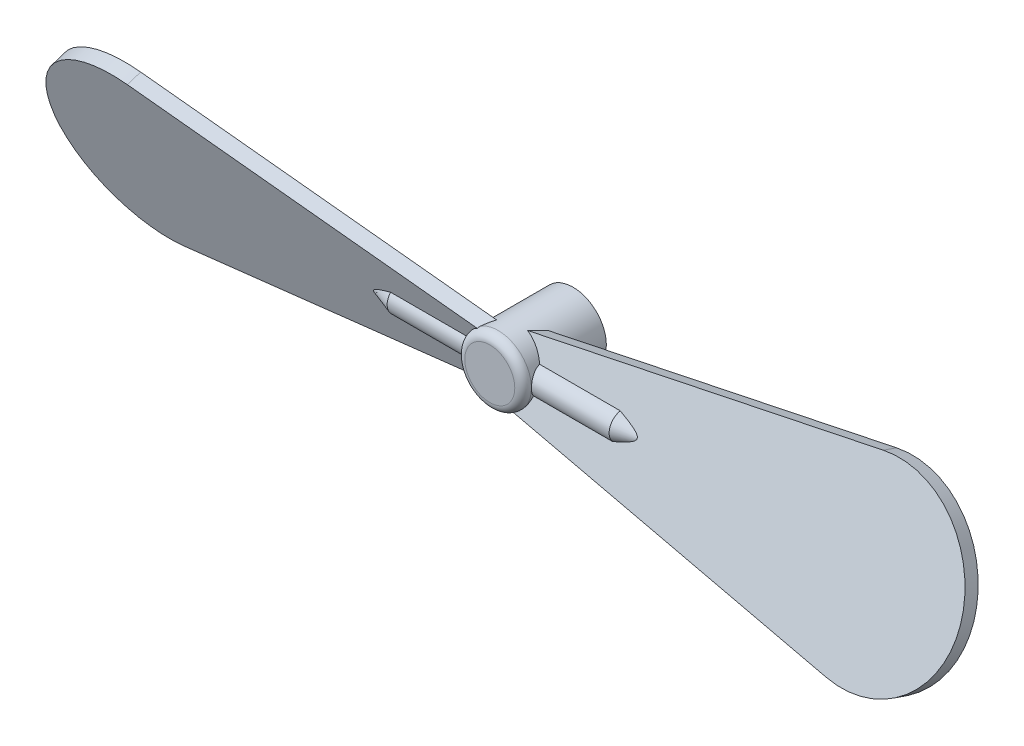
ISO-10303-21;
HEADER;
FILE_DESCRIPTION(('STEP AP214'),'2;1');
FILE_NAME('part.step','',(''),(''),'','','');
FILE_SCHEMA(('AUTOMOTIVE_DESIGN { 1 0 10303 214 1 1 1 1 }'));
ENDSEC;
DATA;
#1=APPLICATION_CONTEXT('core data for automotive mechanical design processes');
#2=APPLICATION_PROTOCOL_DEFINITION('international standard','automotive_design',2000,#1);
#3=PRODUCT_CONTEXT('',#1,'mechanical');
#4=PRODUCT('Part','Part','',(#3));
#5=PRODUCT_RELATED_PRODUCT_CATEGORY('part','',(#4));
#6=PRODUCT_DEFINITION_FORMATION('','',#4);
#7=PRODUCT_DEFINITION_CONTEXT('part definition',#1,'design');
#8=PRODUCT_DEFINITION('design','',#6,#7);
#9=PRODUCT_DEFINITION_SHAPE('','',#8);
#10=(LENGTH_UNIT() NAMED_UNIT(*) SI_UNIT(.MILLI.,.METRE.));
#11=(NAMED_UNIT(*) PLANE_ANGLE_UNIT() SI_UNIT($,.RADIAN.));
#12=(NAMED_UNIT(*) SI_UNIT($,.STERADIAN.) SOLID_ANGLE_UNIT());
#13=UNCERTAINTY_MEASURE_WITH_UNIT(LENGTH_MEASURE(1.E-05),#10,'distance_accuracy_value','');
#14=(GEOMETRIC_REPRESENTATION_CONTEXT(3) GLOBAL_UNCERTAINTY_ASSIGNED_CONTEXT((#13)) GLOBAL_UNIT_ASSIGNED_CONTEXT((#10,
#11,#12)) REPRESENTATION_CONTEXT('',''));
#15=CARTESIAN_POINT('',(0.,0.,0.));
#16=DIRECTION('',(0.,0.,1.));
#17=DIRECTION('',(1.,0.,0.));
#18=AXIS2_PLACEMENT_3D('',#15,#16,#17);
#19=CARTESIAN_POINT('',(0.,0.,-2.2));
#20=DIRECTION('',(0.,0.,1.));
#21=DIRECTION('',(1.,0.,0.));
#22=AXIS2_PLACEMENT_3D('',#19,#20,#21);
#23=CYLINDRICAL_SURFACE('',#22,1.2);
#24=CARTESIAN_POINT('',(0.,0.,0.263932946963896));
#25=DIRECTION('',(0.,-0.320612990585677,0.947210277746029));
#26=DIRECTION('',(0.,0.947210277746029,0.320612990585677));
#27=AXIS2_PLACEMENT_3D('',#24,#25,#26);
#28=ELLIPSE('',#27,1.2668781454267,1.2);
#29=CARTESIAN_POINT('',(-0.444463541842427,-1.11465338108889,-0.113356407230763));
#30=VERTEX_POINT('',#29);
#31=CARTESIAN_POINT('',(-1.09526194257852,-0.490307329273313,0.0979730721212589));
#32=VERTEX_POINT('',#31);
#33=EDGE_CURVE('E45',#30,#32,#28,.F.);
#34=ORIENTED_EDGE('',*,*,#33,.F.);
#35=CARTESIAN_POINT('',(0.,0.,-3.16570927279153));
#36=DIRECTION('',(-0.171102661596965,0.933241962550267,0.315884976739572));
#37=DIRECTION('',(0.0569655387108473,-0.310706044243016,0.948797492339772));
#38=AXIS2_PLACEMENT_3D('',#35,#36,#37);
#39=ELLIPSE('',#38,3.79885112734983,1.2);
#40=CARTESIAN_POINT('',(-0.674866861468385,-0.992247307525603,-0.599790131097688));
#41=VERTEX_POINT('',#40);
#42=EDGE_CURVE('E11',#30,#41,#39,.F.);
#43=ORIENTED_EDGE('',*,*,#42,.T.);
#44=CARTESIAN_POINT('',(0.,0.,-0.263932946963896));
#45=DIRECTION('',(0.,-0.320612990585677,0.947210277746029));
#46=DIRECTION('',(0.,0.947210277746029,0.320612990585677));
#47=AXIS2_PLACEMENT_3D('',#44,#45,#46);
#48=ELLIPSE('',#47,1.2668781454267,1.2);
#49=CARTESIAN_POINT('',(-1.15373283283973,-0.330000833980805,-0.375632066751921));
#50=VERTEX_POINT('',#49);
#51=EDGE_CURVE('E205',#41,#50,#48,.F.);
#52=ORIENTED_EDGE('',*,*,#51,.T.);
#53=CARTESIAN_POINT('',(-1.09087121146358,0.499999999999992,0.));
#54=CARTESIAN_POINT('',(-1.09087407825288,0.499997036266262,0.0266687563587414));
#55=CARTESIAN_POINT('',(-1.0918634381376,0.497852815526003,0.0533810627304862));
#56=CARTESIAN_POINT('',(-1.09569533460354,0.48935871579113,0.106034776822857));
#57=CARTESIAN_POINT('',(-1.09854290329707,0.482997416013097,0.131973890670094));
#58=CARTESIAN_POINT('',(-1.10570767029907,0.466359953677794,0.182224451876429));
#59=CARTESIAN_POINT('',(-1.11001887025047,0.456099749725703,0.206542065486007));
#60=CARTESIAN_POINT('',(-1.11961659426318,0.432002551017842,0.253103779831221));
#61=CARTESIAN_POINT('',(-1.12490288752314,0.418166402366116,0.275348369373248));
#62=CARTESIAN_POINT('',(-1.13622305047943,0.386389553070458,0.318530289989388));
#63=CARTESIAN_POINT('',(-1.14228227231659,0.368261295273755,0.339323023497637));
#64=CARTESIAN_POINT('',(-1.15425718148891,0.328808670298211,0.377680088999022));
#65=CARTESIAN_POINT('',(-1.16017281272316,0.307483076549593,0.395243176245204));
#66=CARTESIAN_POINT('',(-1.17150215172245,0.261105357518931,0.427379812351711));
#67=CARTESIAN_POINT('',(-1.17688295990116,0.235931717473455,0.441790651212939));
#68=CARTESIAN_POINT('',(-1.1862260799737,0.183252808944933,0.466110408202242));
#69=CARTESIAN_POINT('',(-1.19018902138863,0.155748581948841,0.476021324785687));
#70=CARTESIAN_POINT('',(-1.19607008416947,0.100707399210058,0.490535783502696));
#71=CARTESIAN_POINT('',(-1.19808388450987,0.0732466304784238,0.495388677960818));
#72=CARTESIAN_POINT('',(-1.20018731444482,0.0178316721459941,0.500455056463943));
#73=CARTESIAN_POINT('',(-1.20027772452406,-0.0101223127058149,0.500670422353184));
#74=CARTESIAN_POINT('',(-1.19858051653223,-0.0639171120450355,0.496586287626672));
#75=CARTESIAN_POINT('',(-1.19690685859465,-0.0897829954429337,0.492560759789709));
#76=CARTESIAN_POINT('',(-1.19202606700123,-0.140433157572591,0.480578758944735));
#77=CARTESIAN_POINT('',(-1.18881882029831,-0.165217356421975,0.472621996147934));
#78=CARTESIAN_POINT('',(-1.18111940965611,-0.213455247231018,0.452908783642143));
#79=CARTESIAN_POINT('',(-1.17660838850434,-0.23688287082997,0.44109621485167));
#80=CARTESIAN_POINT('',(-1.16674285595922,-0.281484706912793,0.414061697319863));
#81=CARTESIAN_POINT('',(-1.16138804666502,-0.302658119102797,0.398838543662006));
#82=CARTESIAN_POINT('',(-1.14992679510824,-0.343736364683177,0.364167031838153));
#83=CARTESIAN_POINT('',(-1.14379397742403,-0.363446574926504,0.344496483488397));
#84=CARTESIAN_POINT('',(-1.13175144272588,-0.399372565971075,0.302115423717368));
#85=CARTESIAN_POINT('',(-1.12584181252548,-0.415586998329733,0.279403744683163));
#86=CARTESIAN_POINT('',(-1.11472644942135,-0.444560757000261,0.230641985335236));
#87=CARTESIAN_POINT('',(-1.10955023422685,-0.457189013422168,0.204506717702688));
#88=CARTESIAN_POINT('',(-1.10083937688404,-0.477785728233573,0.150207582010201));
#89=CARTESIAN_POINT('',(-1.09730356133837,-0.485757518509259,0.122045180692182));
#90=CARTESIAN_POINT('',(-1.09256485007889,-0.496320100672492,0.0664412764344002));
#91=CARTESIAN_POINT('',(-1.09122547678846,-0.499226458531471,0.03907155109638));
#92=CARTESIAN_POINT('',(-1.09064114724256,-0.500502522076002,-0.0157913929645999));
#93=CARTESIAN_POINT('',(-1.09139546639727,-0.498873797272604,-0.0432845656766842));
#94=CARTESIAN_POINT('',(-1.09477252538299,-0.491413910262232,-0.0957593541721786));
#95=CARTESIAN_POINT('',(-1.09727255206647,-0.485858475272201,-0.12078907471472));
#96=CARTESIAN_POINT('',(-1.10370252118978,-0.471068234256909,-0.169540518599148));
#97=CARTESIAN_POINT('',(-1.10763279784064,-0.461832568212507,-0.193261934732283));
#98=CARTESIAN_POINT('',(-1.116683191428,-0.439510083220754,-0.239846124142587));
#99=CARTESIAN_POINT('',(-1.12184664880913,-0.426276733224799,-0.262629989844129));
#100=CARTESIAN_POINT('',(-1.13272001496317,-0.396480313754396,-0.305763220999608));
#101=CARTESIAN_POINT('',(-1.13843015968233,-0.379915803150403,-0.326111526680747));
#102=CARTESIAN_POINT('',(-1.15031447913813,-0.34233778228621,-0.365520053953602));
#103=CARTESIAN_POINT('',(-1.15648858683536,-0.321071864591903,-0.384340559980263));
#104=CARTESIAN_POINT('',(-1.16817344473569,-0.275540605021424,-0.418188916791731));
#105=CARTESIAN_POINT('',(-1.17368414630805,-0.251275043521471,-0.43321648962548));
#106=CARTESIAN_POINT('',(-1.1834570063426,-0.200261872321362,-0.45903595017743));
#107=CARTESIAN_POINT('',(-1.1877159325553,-0.173508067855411,-0.469816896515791));
#108=CARTESIAN_POINT('',(-1.19447269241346,-0.118343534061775,-0.486646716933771));
#109=CARTESIAN_POINT('',(-1.19697157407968,-0.0899338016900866,-0.492698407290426));
#110=CARTESIAN_POINT('',(-1.19980613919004,-0.034406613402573,-0.499543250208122));
#111=CARTESIAN_POINT('',(-1.2002808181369,-0.00733763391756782,-0.500674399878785));
#112=CARTESIAN_POINT('',(-1.19939809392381,0.0465947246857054,-0.498554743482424));
#113=CARTESIAN_POINT('',(-1.19804101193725,0.0734581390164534,-0.495304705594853));
#114=CARTESIAN_POINT('',(-1.19372026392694,0.125234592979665,-0.484757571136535));
#115=CARTESIAN_POINT('',(-1.19081529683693,0.150183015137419,-0.477608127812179));
#116=CARTESIAN_POINT('',(-1.18371799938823,0.198516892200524,-0.459626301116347));
#117=CARTESIAN_POINT('',(-1.17952542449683,0.221902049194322,-0.448793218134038));
#118=CARTESIAN_POINT('',(-1.17002330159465,0.267609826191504,-0.423204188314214));
#119=CARTESIAN_POINT('',(-1.16467183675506,0.289836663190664,-0.408293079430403));
#120=CARTESIAN_POINT('',(-1.15348624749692,0.331567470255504,-0.375197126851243));
#121=CARTESIAN_POINT('',(-1.14765194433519,0.351070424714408,-0.3570110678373));
#122=CARTESIAN_POINT('',(-1.13565938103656,0.388179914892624,-0.316422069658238));
#123=CARTESIAN_POINT('',(-1.12950609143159,0.405567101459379,-0.293816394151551));
#124=CARTESIAN_POINT('',(-1.11798221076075,0.436333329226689,-0.245816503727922));
#125=CARTESIAN_POINT('',(-1.11261205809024,0.449710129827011,-0.220420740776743));
#126=CARTESIAN_POINT('',(-1.10337023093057,0.4719310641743,-0.167622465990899));
#127=CARTESIAN_POINT('',(-1.09949061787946,0.480799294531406,-0.140231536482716));
#128=CARTESIAN_POINT('',(-1.09376321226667,0.493694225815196,-0.0841841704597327));
#129=CARTESIAN_POINT('',(-1.09190860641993,0.497737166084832,-0.0555323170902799));
#130=CARTESIAN_POINT('',(-1.09097991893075,0.499761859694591,-0.0178565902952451));
#131=CARTESIAN_POINT('',(-1.0908702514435,0.500000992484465,-0.00893073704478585));
#132=CARTESIAN_POINT('',(-1.09087121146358,0.499999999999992,0.));
#133=B_SPLINE_CURVE_WITH_KNOTS('',3,(#53,#54,#55,#56,#57,#58,#59,#60,#61,#62,#63,#64,#65,#66,
#67,#68,#69,#70,#71,#72,#73,#74,#75,#76,#77,#78,#79,#80,#81,#82,#83,#84,#85,#86,#87,#88,#89,#90,
#91,#92,#93,#94,#95,#96,#97,#98,#99,#100,#101,#102,#103,#104,#105,#106,#107,#108,#109,#110,#111,
#112,#113,#114,#115,#116,#117,#118,#119,#120,#121,#122,#123,#124,#125,#126,#127,#128,#129,#130,
#131,#132),.UNSPECIFIED.,.T.,.F.,(4,2,2,2,2,2,2,2,2,2,2,2,2,2,2,2,2,2,2,2,2,2,2,2,2,2,2,2,2,2,2,
2,2,2,2,2,2,2,2,4),(0.,0.0799806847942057,0.16017886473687,0.240052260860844,0.31990677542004,
0.404267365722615,0.488660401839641,0.576713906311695,0.664728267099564,0.748162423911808,
0.831562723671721,0.90988736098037,0.988217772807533,1.06774325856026,1.14729688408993,
1.23245812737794,1.31765216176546,1.40564618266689,1.49357716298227,1.57580311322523,
1.65800061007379,1.73493560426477,1.81188858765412,1.89210050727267,1.97234720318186,
2.05912665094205,2.14591245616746,2.23292042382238,2.31987653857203,2.40075454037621,
2.48161836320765,2.55961366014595,2.63762377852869,2.71915945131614,2.80072544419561,
2.88784170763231,2.97500655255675,3.06170050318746,3.14810185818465,3.17488550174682),.UNSPECIFIED.);
#134=CARTESIAN_POINT('',(-1.09526194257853,0.490307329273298,-0.0979730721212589));
#135=VERTEX_POINT('',#134);
#136=EDGE_CURVE('E271',#50,#135,#133,.T.);
#137=ORIENTED_EDGE('',*,*,#136,.T.);
#138=CARTESIAN_POINT('',(-0.444463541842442,1.11465338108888,0.113356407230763));
#139=VERTEX_POINT('',#138);
#140=EDGE_CURVE('E203',#135,#139,#48,.F.);
#141=ORIENTED_EDGE('',*,*,#140,.T.);
#142=CARTESIAN_POINT('',(0.,0.,3.16570927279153));
#143=DIRECTION('',(-0.171102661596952,-0.93324196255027,-0.315884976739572));
#144=DIRECTION('',(-0.056965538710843,-0.310706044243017,0.948797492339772));
#145=AXIS2_PLACEMENT_3D('',#142,#143,#144);
#146=ELLIPSE('',#145,3.79885112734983,1.2);
#147=CARTESIAN_POINT('',(-0.634387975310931,1.01860291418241,0.5));
#148=VERTEX_POINT('',#147);
#149=EDGE_CURVE('E217',#139,#148,#146,.F.);
#150=ORIENTED_EDGE('',*,*,#149,.T.);
#151=CARTESIAN_POINT('',(0.,0.,0.5));
#152=DIRECTION('',(0.,0.,1.));
#153=DIRECTION('',(1.,0.,0.));
#154=AXIS2_PLACEMENT_3D('',#151,#152,#153);
#155=CIRCLE('',#154,1.2);
#156=CARTESIAN_POINT('',(1.2,0.,0.5));
#157=VERTEX_POINT('',#156);
#158=EDGE_CURVE('E346',#148,#157,#155,.F.);
#159=ORIENTED_EDGE('',*,*,#158,.T.);
#160=CARTESIAN_POINT('',(1.2,0.,-0.499999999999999));
#161=CARTESIAN_POINT('',(1.19999783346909,-0.0267832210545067,-0.49999711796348));
#162=CARTESIAN_POINT('',(1.19909293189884,-0.0536085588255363,-0.497835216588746));
#163=CARTESIAN_POINT('',(1.19556061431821,-0.106498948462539,-0.489264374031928));
#164=CARTESIAN_POINT('',(1.19292870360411,-0.132561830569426,-0.4828443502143));
#165=CARTESIAN_POINT('',(1.18622515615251,-0.183075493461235,-0.466035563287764));
#166=CARTESIAN_POINT('',(1.18215839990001,-0.207531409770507,-0.45566024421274));
#167=CARTESIAN_POINT('',(1.17298114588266,-0.254331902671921,-0.431290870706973));
#168=CARTESIAN_POINT('',(1.1678709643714,-0.276677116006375,-0.417297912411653));
#169=CARTESIAN_POINT('',(1.15683131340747,-0.319779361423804,-0.385348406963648));
#170=CARTESIAN_POINT('',(1.15087501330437,-0.340416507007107,-0.367239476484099));
#171=CARTESIAN_POINT('',(1.13893085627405,-0.378463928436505,-0.327894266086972));
#172=CARTESIAN_POINT('',(1.13294298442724,-0.395872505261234,-0.306656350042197));
#173=CARTESIAN_POINT('',(1.12128408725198,-0.427814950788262,-0.260389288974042));
#174=CARTESIAN_POINT('',(1.11564314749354,-0.4421652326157,-0.235225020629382));
#175=CARTESIAN_POINT('',(1.10574228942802,-0.466375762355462,-0.182570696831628));
#176=CARTESIAN_POINT('',(1.10148166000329,-0.476238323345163,-0.155081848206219));
#177=CARTESIAN_POINT('',(1.09511422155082,-0.490698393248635,-0.0999385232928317));
#178=CARTESIAN_POINT('',(1.09291355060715,-0.495526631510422,-0.0723558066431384));
#179=CARTESIAN_POINT('',(1.09064530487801,-0.500500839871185,-0.0166906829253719));
#180=CARTESIAN_POINT('',(1.09057655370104,-0.500649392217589,0.0113914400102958));
#181=CARTESIAN_POINT('',(1.09250047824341,-0.496433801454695,0.064960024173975));
#182=CARTESIAN_POINT('',(1.09433553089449,-0.492414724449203,0.0904804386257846));
#183=CARTESIAN_POINT('',(1.09959393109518,-0.480556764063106,0.140444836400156));
#184=CARTESIAN_POINT('',(1.10301758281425,-0.472717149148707,0.164888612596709));
#185=CARTESIAN_POINT('',(1.11114473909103,-0.453287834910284,0.212623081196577));
#186=CARTESIAN_POINT('',(1.11587392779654,-0.441621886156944,0.235878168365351));
#187=CARTESIAN_POINT('',(1.12607332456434,-0.414924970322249,0.280191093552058));
#188=CARTESIAN_POINT('',(1.13154382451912,-0.399892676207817,0.301248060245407));
#189=CARTESIAN_POINT('',(1.14317190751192,-0.365398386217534,0.342439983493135));
#190=CARTESIAN_POINT('',(1.14934848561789,-0.34566939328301,0.362346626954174));
#191=CARTESIAN_POINT('',(1.16130269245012,-0.303091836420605,0.398645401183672));
#192=CARTESIAN_POINT('',(1.16708022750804,-0.280242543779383,0.415036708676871));
#193=CARTESIAN_POINT('',(1.17775313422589,-0.231379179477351,0.444174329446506));
#194=CARTESIAN_POINT('',(1.18262506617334,-0.205304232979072,0.456827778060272));
#195=CARTESIAN_POINT('',(1.19075792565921,-0.151140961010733,0.477488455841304));
#196=CARTESIAN_POINT('',(1.19401974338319,-0.123053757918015,0.485498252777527));
#197=CARTESIAN_POINT('',(1.19839856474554,-0.0675712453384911,0.496166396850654));
#198=CARTESIAN_POINT('',(1.19963816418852,-0.0402445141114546,0.499131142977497));
#199=CARTESIAN_POINT('',(1.20022420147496,0.0145418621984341,0.50053848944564));
#200=CARTESIAN_POINT('',(1.19957118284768,0.0420014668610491,0.498982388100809));
#201=CARTESIAN_POINT('',(1.19652487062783,0.0948392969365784,0.491611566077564));
#202=CARTESIAN_POINT('',(1.19421954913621,0.120253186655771,0.486012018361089));
#203=CARTESIAN_POINT('',(1.18819442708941,0.169753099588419,0.471012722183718));
#204=CARTESIAN_POINT('',(1.18447444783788,0.193838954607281,0.461612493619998));
#205=CARTESIAN_POINT('',(1.17583308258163,0.24084359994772,0.438971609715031));
#206=CARTESIAN_POINT('',(1.17087796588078,0.263702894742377,0.425620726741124));
#207=CARTESIAN_POINT('',(1.1602952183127,0.306938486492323,0.395578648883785));
#208=CARTESIAN_POINT('',(1.15466730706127,0.327313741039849,0.378886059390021));
#209=CARTESIAN_POINT('',(1.14284835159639,0.366533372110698,0.341238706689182));
#210=CARTESIAN_POINT('',(1.13664580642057,0.385164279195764,0.320064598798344));
#211=CARTESIAN_POINT('',(1.12473734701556,0.418667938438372,0.274791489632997));
#212=CARTESIAN_POINT('',(1.11903154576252,0.433539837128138,0.250691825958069));
#213=CARTESIAN_POINT('',(1.10872554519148,0.459263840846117,0.199754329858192));
#214=CARTESIAN_POINT('',(1.1041422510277,0.470055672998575,0.172882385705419));
#215=CARTESIAN_POINT('',(1.09683342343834,0.486869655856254,0.117451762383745));
#216=CARTESIAN_POINT('',(1.09410635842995,0.49289573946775,0.0888944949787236));
#217=CARTESIAN_POINT('',(1.09105265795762,0.499616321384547,0.0332725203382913));
#218=CARTESIAN_POINT('',(1.09055740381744,0.500685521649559,0.00626213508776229));
#219=CARTESIAN_POINT('',(1.0915754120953,0.498462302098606,-0.0475371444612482));
#220=CARTESIAN_POINT('',(1.09308836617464,0.49517055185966,-0.0743260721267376));
#221=CARTESIAN_POINT('',(1.09779820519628,0.484633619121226,-0.125637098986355));
#222=CARTESIAN_POINT('',(1.10091341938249,0.477579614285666,-0.150206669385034));
#223=CARTESIAN_POINT('',(1.10841272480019,0.459905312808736,-0.197819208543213));
#224=CARTESIAN_POINT('',(1.11279717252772,0.449284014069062,-0.220861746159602));
#225=CARTESIAN_POINT('',(1.12266781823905,0.4240411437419,-0.266278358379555));
#226=CARTESIAN_POINT('',(1.12820441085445,0.409217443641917,-0.28852893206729));
#227=CARTESIAN_POINT('',(1.13961475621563,0.376273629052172,-0.330344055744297));
#228=CARTESIAN_POINT('',(1.14548862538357,0.358152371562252,-0.349907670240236));
#229=CARTESIAN_POINT('',(1.15742557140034,0.317560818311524,-0.38725947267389));
#230=CARTESIAN_POINT('',(1.16347127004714,0.29486989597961,-0.404814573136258));
#231=CARTESIAN_POINT('',(1.1746405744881,0.246640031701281,-0.435879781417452));
#232=CARTESIAN_POINT('',(1.17976375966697,0.221099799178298,-0.449388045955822));
#233=CARTESIAN_POINT('',(1.18843673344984,0.16829282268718,-0.471683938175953));
#234=CARTESIAN_POINT('',(1.19201113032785,0.141061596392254,-0.480545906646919));
#235=CARTESIAN_POINT('',(1.1972840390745,0.0853641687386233,-0.493482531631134));
#236=CARTESIAN_POINT('',(1.19898842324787,0.0569021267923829,-0.497572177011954));
#237=CARTESIAN_POINT('',(1.19988915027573,0.0188944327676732,-0.499733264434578));
#238=CARTESIAN_POINT('',(1.20000076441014,0.0094498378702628,-0.500001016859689));
#239=CARTESIAN_POINT('',(1.2,0.,-0.499999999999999));
#240=B_SPLINE_CURVE_WITH_KNOTS('',3,(#160,#161,#162,#163,#164,#165,#166,#167,#168,#169,#170,
#171,#172,#173,#174,#175,#176,#177,#178,#179,#180,#181,#182,#183,#184,#185,#186,#187,#188,#189,
#190,#191,#192,#193,#194,#195,#196,#197,#198,#199,#200,#201,#202,#203,#204,#205,#206,#207,#208,
#209,#210,#211,#212,#213,#214,#215,#216,#217,#218,#219,#220,#221,#222,#223,#224,#225,#226,#227,
#228,#229,#230,#231,#232,#233,#234,#235,#236,#237,#238,#239),.UNSPECIFIED.,.T.,.F.,(4,2,2,2,2,2,
2,2,2,2,2,2,2,2,2,2,2,2,2,2,2,2,2,2,2,2,2,2,2,2,2,2,2,2,2,2,2,2,2,4),(0.,0.0803227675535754,
0.160855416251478,0.24111674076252,0.321353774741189,0.405271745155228,0.489233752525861,
0.577326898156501,0.665374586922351,0.749181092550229,0.832941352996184,0.910280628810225,
0.987634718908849,1.06663485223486,1.14566618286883,1.23137656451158,1.31710699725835,
1.40481622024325,1.49247689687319,1.574593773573,1.65668706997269,1.73470635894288,
1.81273550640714,1.89318854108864,1.97367522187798,2.05991395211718,2.14617224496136,
2.23365915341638,2.32107378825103,2.40175951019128,2.48243284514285,2.55935059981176,
2.63628997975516,2.71785557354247,2.79944949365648,2.88698613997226,2.97456259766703,
3.06069142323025,3.14654900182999,3.1748890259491),.UNSPECIFIED.);
#241=CARTESIAN_POINT('',(1.09526194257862,0.490307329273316,0.0979730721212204));
#242=VERTEX_POINT('',#241);
#243=EDGE_CURVE('E287',#157,#242,#240,.T.);
#244=ORIENTED_EDGE('',*,*,#243,.T.);
#245=CARTESIAN_POINT('',(0.,0.,0.263932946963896));
#246=DIRECTION('',(0.,0.320612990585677,0.947210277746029));
#247=DIRECTION('',(0.,-0.947210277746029,0.320612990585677));
#248=AXIS2_PLACEMENT_3D('',#245,#246,#247);
#249=ELLIPSE('',#248,1.2668781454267,1.2);
#250=CARTESIAN_POINT('',(0.444463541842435,1.11465338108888,-0.113356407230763));
#251=VERTEX_POINT('',#250);
#252=EDGE_CURVE('E443',#251,#242,#249,.F.);
#253=ORIENTED_EDGE('',*,*,#252,.F.);
#254=CARTESIAN_POINT('',(0.,0.,-3.16570927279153));
#255=DIRECTION('',(0.171102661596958,-0.933241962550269,0.315884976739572));
#256=DIRECTION('',(-0.0569655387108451,0.310706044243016,0.948797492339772));
#257=AXIS2_PLACEMENT_3D('',#254,#255,#256);
#258=ELLIPSE('',#257,3.79885112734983,1.2);
#259=CARTESIAN_POINT('',(0.674866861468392,0.992247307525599,-0.599790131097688));
#260=VERTEX_POINT('',#259);
#261=EDGE_CURVE('E374',#251,#260,#258,.F.);
#262=ORIENTED_EDGE('',*,*,#261,.T.);
#263=CARTESIAN_POINT('',(0.,0.,-0.263932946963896));
#264=DIRECTION('',(0.,0.320612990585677,0.947210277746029));
#265=DIRECTION('',(0.,-0.947210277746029,0.320612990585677));
#266=AXIS2_PLACEMENT_3D('',#263,#264,#265);
#267=ELLIPSE('',#266,1.2668781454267,1.2);
#268=CARTESIAN_POINT('',(1.15373283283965,0.330000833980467,-0.375632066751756));
#269=VERTEX_POINT('',#268);
#270=EDGE_CURVE('E406',#260,#269,#267,.F.);
#271=ORIENTED_EDGE('',*,*,#270,.T.);
#272=CARTESIAN_POINT('',(1.09526194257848,-0.490307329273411,-0.0979730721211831));
#273=VERTEX_POINT('',#272);
#274=EDGE_CURVE('E295',#269,#273,#240,.T.);
#275=ORIENTED_EDGE('',*,*,#274,.T.);
#276=CARTESIAN_POINT('',(0.444463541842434,-1.11465338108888,0.113356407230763));
#277=VERTEX_POINT('',#276);
#278=EDGE_CURVE('E415',#273,#277,#267,.F.);
#279=ORIENTED_EDGE('',*,*,#278,.T.);
#280=CARTESIAN_POINT('',(0.,0.,3.16570927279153));
#281=DIRECTION('',(0.171102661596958,0.933241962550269,-0.315884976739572));
#282=DIRECTION('',(0.0569655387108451,0.310706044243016,0.948797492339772));
#283=AXIS2_PLACEMENT_3D('',#280,#281,#282);
#284=ELLIPSE('',#283,3.79885112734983,1.2);
#285=CARTESIAN_POINT('',(0.634387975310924,-1.01860291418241,0.5));
#286=VERTEX_POINT('',#285);
#287=EDGE_CURVE('E365',#277,#286,#284,.F.);
#288=ORIENTED_EDGE('',*,*,#287,.T.);
#289=CARTESIAN_POINT('',(-1.2,0.,0.5));
#290=VERTEX_POINT('',#289);
#291=EDGE_CURVE('E356',#286,#290,#155,.F.);
#292=ORIENTED_EDGE('',*,*,#291,.T.);
#293=EDGE_CURVE('E266',#290,#32,#133,.T.);
#294=ORIENTED_EDGE('',*,*,#293,.T.);
#295=EDGE_LOOP('',(#34,#43,#52,#137,#141,#150,#159,#244,#253,#262,#271,#275,#279,#288,#292,#294));
#296=FACE_BOUND('',#295,.T.);
#297=CARTESIAN_POINT('',(0.,0.,-2.2));
#298=DIRECTION('',(0.,0.,1.));
#299=DIRECTION('',(1.,0.,0.));
#300=AXIS2_PLACEMENT_3D('',#297,#298,#299);
#301=CIRCLE('',#300,1.2);
#302=CARTESIAN_POINT('',(1.2,0.,-2.2));
#303=VERTEX_POINT('',#302);
#304=EDGE_CURVE('E294',#303,#303,#301,.T.);
#305=ORIENTED_EDGE('',*,*,#304,.T.);
#306=EDGE_LOOP('',(#305));
#307=FACE_BOUND('',#306,.T.);
#308=ADVANCED_FACE('F30',(#296,#307),#23,.T.);
#309=CARTESIAN_POINT('',(0.,0.,0.5));
#310=DIRECTION('',(0.,0.,1.));
#311=DIRECTION('',(1.,0.,0.));
#312=AXIS2_PLACEMENT_3D('',#309,#310,#311);
#313=TOROIDAL_SURFACE('',#312,0.9,0.3);
#314=CARTESIAN_POINT('',(0.,0.,0.8));
#315=DIRECTION('',(0.,0.,1.));
#316=DIRECTION('',(1.,0.,0.));
#317=AXIS2_PLACEMENT_3D('',#314,#315,#316);
#318=CIRCLE('',#317,0.9);
#319=CARTESIAN_POINT('',(0.9,0.,0.8));
#320=VERTEX_POINT('',#319);
#321=EDGE_CURVE('E354',#320,#320,#318,.T.);
#322=ORIENTED_EDGE('',*,*,#321,.F.);
#323=EDGE_LOOP('',(#322));
#324=FACE_BOUND('',#323,.T.);
#325=ORIENTED_EDGE('',*,*,#158,.F.);
#326=CARTESIAN_POINT('',(-0.634303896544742,1.018655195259,0.499800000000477));
#327=CARTESIAN_POINT('',(-0.638794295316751,1.01587889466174,0.51043450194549));
#328=CARTESIAN_POINT('',(-0.642502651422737,1.01285948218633,0.521363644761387));
#329=CARTESIAN_POINT('',(-0.648151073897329,1.00637365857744,0.543584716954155));
#330=CARTESIAN_POINT('',(-0.650084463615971,1.0029056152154,0.5548778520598));
#331=CARTESIAN_POINT('',(-0.651945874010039,0.995567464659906,0.577565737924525));
#332=CARTESIAN_POINT('',(-0.651865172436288,0.991695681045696,0.588960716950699));
#333=CARTESIAN_POINT('',(-0.649575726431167,0.983677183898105,0.611410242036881));
#334=CARTESIAN_POINT('',(-0.647371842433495,0.979531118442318,0.622465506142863));
#335=CARTESIAN_POINT('',(-0.641073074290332,0.971327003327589,0.643291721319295));
#336=CARTESIAN_POINT('',(-0.637090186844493,0.967276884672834,0.653099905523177));
#337=CARTESIAN_POINT('',(-0.627441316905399,0.959160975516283,0.67185090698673));
#338=CARTESIAN_POINT('',(-0.621773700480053,0.955095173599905,0.680792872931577));
#339=CARTESIAN_POINT('',(-0.608933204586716,0.947007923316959,0.697730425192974));
#340=CARTESIAN_POINT('',(-0.601742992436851,0.942987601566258,0.705713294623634));
#341=CARTESIAN_POINT('',(-0.586204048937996,0.935124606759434,0.720526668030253));
#342=CARTESIAN_POINT('',(-0.577856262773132,0.931281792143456,0.727358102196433));
#343=CARTESIAN_POINT('',(-0.555443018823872,0.921765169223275,0.743333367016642));
#344=CARTESIAN_POINT('',(-0.540752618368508,0.916243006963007,0.751690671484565));
#345=CARTESIAN_POINT('',(-0.509965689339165,0.905742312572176,0.766037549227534));
#346=CARTESIAN_POINT('',(-0.493858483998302,0.900768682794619,0.772006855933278));
#347=CARTESIAN_POINT('',(-0.461772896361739,0.891622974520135,0.781647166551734));
#348=CARTESIAN_POINT('',(-0.44583305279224,0.88742236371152,0.785423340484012));
#349=CARTESIAN_POINT('',(-0.413544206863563,0.879443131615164,0.791507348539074));
#350=CARTESIAN_POINT('',(-0.397194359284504,0.875665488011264,0.793811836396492));
#351=CARTESIAN_POINT('',(-0.364768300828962,0.868569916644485,0.797210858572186));
#352=CARTESIAN_POINT('',(-0.348697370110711,0.865242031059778,0.798337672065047));
#353=CARTESIAN_POINT('',(-0.316546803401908,0.858873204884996,0.799738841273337));
#354=CARTESIAN_POINT('',(-0.300467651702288,0.855830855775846,0.800017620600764));
#355=CARTESIAN_POINT('',(-0.284385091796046,0.852888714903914,0.799998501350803));
#356=B_SPLINE_CURVE_WITH_KNOTS('',3,(#326,#327,#328,#329,#330,#331,#332,#333,#334,#335,#336,
#337,#338,#339,#340,#341,#342,#343,#344,#345,#346,#347,#348,#349,#350,#351,#352,#353,#354,#355),
.UNSPECIFIED.,.F.,.F.,(4,2,2,2,2,2,2,2,2,2,2,2,2,2,4),(0.,0.0356261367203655,0.0713857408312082,
0.107300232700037,0.143132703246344,0.176972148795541,0.210844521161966,0.245125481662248,
0.2793786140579,0.332417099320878,0.385896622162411,0.436537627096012,0.487293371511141,
0.536618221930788,0.585685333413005),.UNSPECIFIED.);
#357=CARTESIAN_POINT('',(-0.650888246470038,0.988302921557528,0.598455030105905));
#358=VERTEX_POINT('',#357);
#359=EDGE_CURVE('E39',#148,#358,#356,.T.);
#360=ORIENTED_EDGE('',*,*,#359,.T.);
#361=CARTESIAN_POINT('',(-0.976941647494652,0.696839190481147,0.4998));
#362=CARTESIAN_POINT('',(-0.948475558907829,0.736790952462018,0.513322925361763));
#363=CARTESIAN_POINT('',(-0.916722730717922,0.774547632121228,0.526102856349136));
#364=CARTESIAN_POINT('',(-0.847782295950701,0.8451106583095,0.549987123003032));
#365=CARTESIAN_POINT('',(-0.810611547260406,0.877931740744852,0.561096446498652));
#366=CARTESIAN_POINT('',(-0.726533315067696,0.942337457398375,0.582896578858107));
#367=CARTESIAN_POINT('',(-0.678988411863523,0.973173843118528,0.593334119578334));
#368=CARTESIAN_POINT('',(-0.579533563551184,1.02778755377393,0.611819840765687));
#369=CARTESIAN_POINT('',(-0.527618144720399,1.05155585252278,0.619864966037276));
#370=CARTESIAN_POINT('',(-0.414553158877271,1.09422387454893,0.634307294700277));
#371=CARTESIAN_POINT('',(-0.353031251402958,1.11223810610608,0.640404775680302));
#372=CARTESIAN_POINT('',(-0.227836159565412,1.13931678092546,0.649570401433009));
#373=CARTESIAN_POINT('',(-0.164162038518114,1.14837727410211,0.652637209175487));
#374=CARTESIAN_POINT('',(-0.029007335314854,1.15812807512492,0.655937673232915));
#375=CARTESIAN_POINT('',(0.0425584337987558,1.15778292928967,0.655820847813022));
#376=CARTESIAN_POINT('',(0.18473874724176,1.14612704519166,0.651875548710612));
#377=CARTESIAN_POINT('',(0.255352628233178,1.13480902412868,0.648044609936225));
#378=CARTESIAN_POINT('',(0.395862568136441,1.10053321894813,0.636442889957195));
#379=CARTESIAN_POINT('',(0.465660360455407,1.07720837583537,0.628547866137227));
#380=CARTESIAN_POINT('',(0.599418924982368,1.01877508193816,0.608769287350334));
#381=CARTESIAN_POINT('',(0.663392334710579,0.983692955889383,0.596894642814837));
#382=CARTESIAN_POINT('',(0.772309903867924,0.90931286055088,0.57171836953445));
#383=CARTESIAN_POINT('',(0.818626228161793,0.871820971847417,0.559028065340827));
#384=CARTESIAN_POINT('',(0.903873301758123,0.789592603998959,0.531195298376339));
#385=CARTESIAN_POINT('',(0.942765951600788,0.744820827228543,0.516040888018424));
#386=CARTESIAN_POINT('',(0.976941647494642,0.696839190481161,0.4998));
#387=B_SPLINE_CURVE_WITH_KNOTS('',3,(#361,#362,#363,#364,#365,#366,#367,#368,#369,#370,#371,
#372,#373,#374,#375,#376,#377,#378,#379,#380,#381,#382,#383,#384,#385,#386),.UNSPECIFIED.,.F.,
.F.,(4,2,2,2,2,2,2,2,2,2,2,2,4),(0.,0.152377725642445,0.304291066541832,0.476458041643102,
0.648843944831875,0.84124173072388,1.03372435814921,1.24747478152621,1.46136717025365,
1.68222521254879,1.90259201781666,2.08447595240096,2.2672696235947),.UNSPECIFIED.);
#388=CARTESIAN_POINT('',(-0.976519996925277,0.697430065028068,0.5));
#389=VERTEX_POINT('',#388);
#390=EDGE_CURVE('E167',#389,#358,#387,.T.);
#391=ORIENTED_EDGE('',*,*,#390,.F.);
#392=EDGE_CURVE('E335',#290,#389,#155,.F.);
#393=ORIENTED_EDGE('',*,*,#392,.F.);
#394=ORIENTED_EDGE('',*,*,#291,.F.);
#395=CARTESIAN_POINT('',(0.634303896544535,-1.01865519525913,0.499800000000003));
#396=CARTESIAN_POINT('',(0.638794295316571,-1.01587889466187,0.510434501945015));
#397=CARTESIAN_POINT('',(0.642502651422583,-1.01285948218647,0.521363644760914));
#398=CARTESIAN_POINT('',(0.64815107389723,-1.00637365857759,0.543584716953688));
#399=CARTESIAN_POINT('',(0.6500844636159,-1.00290561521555,0.554877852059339));
#400=CARTESIAN_POINT('',(0.651945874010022,-0.995567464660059,0.57756573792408));
#401=CARTESIAN_POINT('',(0.651865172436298,-0.991695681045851,0.588960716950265));
#402=CARTESIAN_POINT('',(0.649575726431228,-0.983677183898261,0.611410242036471));
#403=CARTESIAN_POINT('',(0.647371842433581,-0.979531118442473,0.622465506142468));
#404=CARTESIAN_POINT('',(0.641073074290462,-0.971327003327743,0.643291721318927));
#405=CARTESIAN_POINT('',(0.637090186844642,-0.967276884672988,0.653099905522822));
#406=CARTESIAN_POINT('',(0.627441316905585,-0.959160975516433,0.671850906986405));
#407=CARTESIAN_POINT('',(0.621773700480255,-0.955095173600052,0.680792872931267));
#408=CARTESIAN_POINT('',(0.608933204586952,-0.947007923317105,0.697730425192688));
#409=CARTESIAN_POINT('',(0.601742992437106,-0.942987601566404,0.705713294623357));
#410=CARTESIAN_POINT('',(0.586204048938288,-0.93512460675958,0.720526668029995));
#411=CARTESIAN_POINT('',(0.577856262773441,-0.931281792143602,0.727358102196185));
#412=CARTESIAN_POINT('',(0.555443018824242,-0.921765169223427,0.743333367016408));
#413=CARTESIAN_POINT('',(0.540752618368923,-0.916243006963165,0.751690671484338));
#414=CARTESIAN_POINT('',(0.509965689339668,-0.905742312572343,0.766037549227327));
#415=CARTESIAN_POINT('',(0.493858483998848,-0.900768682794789,0.772006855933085));
#416=CARTESIAN_POINT('',(0.461772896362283,-0.891622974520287,0.781647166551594));
#417=CARTESIAN_POINT('',(0.445833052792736,-0.887422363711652,0.785423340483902));
#418=CARTESIAN_POINT('',(0.413544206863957,-0.879443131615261,0.791507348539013));
#419=CARTESIAN_POINT('',(0.397194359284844,-0.875665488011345,0.793811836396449));
#420=CARTESIAN_POINT('',(0.364768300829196,-0.868569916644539,0.797210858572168));
#421=CARTESIAN_POINT('',(0.348697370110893,-0.865242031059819,0.798337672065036));
#422=CARTESIAN_POINT('',(0.316546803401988,-0.858873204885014,0.799738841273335));
#423=CARTESIAN_POINT('',(0.300467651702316,-0.855830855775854,0.800017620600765));
#424=CARTESIAN_POINT('',(0.284385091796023,-0.852888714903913,0.799998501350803));
#425=B_SPLINE_CURVE_WITH_KNOTS('',3,(#395,#396,#397,#398,#399,#400,#401,#402,#403,#404,#405,
#406,#407,#408,#409,#410,#411,#412,#413,#414,#415,#416,#417,#418,#419,#420,#421,#422,#423,#424),
.UNSPECIFIED.,.F.,.F.,(4,2,2,2,2,2,2,2,2,2,2,2,2,2,4),(0.,0.0356261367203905,0.0713857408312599,
0.107300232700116,0.143132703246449,0.176972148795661,0.210844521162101,0.245125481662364,
0.279378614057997,0.33241709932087,0.385896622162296,0.436537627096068,0.487293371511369,
0.536618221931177,0.58568533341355),.UNSPECIFIED.);
#426=CARTESIAN_POINT('',(0.650888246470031,-0.988302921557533,0.598455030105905));
#427=VERTEX_POINT('',#426);
#428=EDGE_CURVE('E367',#286,#427,#425,.T.);
#429=ORIENTED_EDGE('',*,*,#428,.T.);
#430=CARTESIAN_POINT('',(0.976941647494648,-0.696839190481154,0.4998));
#431=CARTESIAN_POINT('',(0.948475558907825,-0.736790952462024,0.513322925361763));
#432=CARTESIAN_POINT('',(0.916722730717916,-0.774547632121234,0.526102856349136));
#433=CARTESIAN_POINT('',(0.847782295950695,-0.845110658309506,0.549987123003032));
#434=CARTESIAN_POINT('',(0.8106115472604,-0.877931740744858,0.561096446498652));
#435=CARTESIAN_POINT('',(0.726533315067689,-0.94233745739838,0.582896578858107));
#436=CARTESIAN_POINT('',(0.678988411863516,-0.973173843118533,0.593334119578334));
#437=CARTESIAN_POINT('',(0.579533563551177,-1.02778755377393,0.611819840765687));
#438=CARTESIAN_POINT('',(0.527618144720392,-1.05155585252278,0.619864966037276));
#439=CARTESIAN_POINT('',(0.414553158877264,-1.09422387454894,0.634307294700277));
#440=CARTESIAN_POINT('',(0.353031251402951,-1.11223810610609,0.640404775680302));
#441=CARTESIAN_POINT('',(0.227836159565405,-1.13931678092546,0.649570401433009));
#442=CARTESIAN_POINT('',(0.164162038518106,-1.14837727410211,0.652637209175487));
#443=CARTESIAN_POINT('',(0.0290073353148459,-1.15812807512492,0.655937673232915));
#444=CARTESIAN_POINT('',(-0.0425584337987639,-1.15778292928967,0.655820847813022));
#445=CARTESIAN_POINT('',(-0.184738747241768,-1.14612704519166,0.651875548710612));
#446=CARTESIAN_POINT('',(-0.255352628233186,-1.13480902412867,0.648044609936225));
#447=CARTESIAN_POINT('',(-0.395862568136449,-1.10053321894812,0.636442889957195));
#448=CARTESIAN_POINT('',(-0.465660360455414,-1.07720837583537,0.628547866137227));
#449=CARTESIAN_POINT('',(-0.599418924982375,-1.01877508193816,0.608769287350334));
#450=CARTESIAN_POINT('',(-0.663392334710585,-0.983692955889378,0.596894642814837));
#451=CARTESIAN_POINT('',(-0.77230990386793,-0.909312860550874,0.57171836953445));
#452=CARTESIAN_POINT('',(-0.8186262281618,-0.871820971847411,0.559028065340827));
#453=CARTESIAN_POINT('',(-0.903873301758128,-0.789592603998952,0.531195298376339));
#454=CARTESIAN_POINT('',(-0.942765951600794,-0.744820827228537,0.516040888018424));
#455=CARTESIAN_POINT('',(-0.976941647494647,-0.696839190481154,0.4998));
#456=B_SPLINE_CURVE_WITH_KNOTS('',3,(#430,#431,#432,#433,#434,#435,#436,#437,#438,#439,#440,
#441,#442,#443,#444,#445,#446,#447,#448,#449,#450,#451,#452,#453,#454,#455),.UNSPECIFIED.,.F.,
.F.,(4,2,2,2,2,2,2,2,2,2,2,2,4),(0.,0.152377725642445,0.304291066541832,0.476458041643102,
0.648843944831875,0.84124173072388,1.03372435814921,1.24747478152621,1.46136717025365,
1.68222521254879,1.90259201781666,2.08447595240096,2.2672696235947),.UNSPECIFIED.);
#457=CARTESIAN_POINT('',(0.976519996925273,-0.697430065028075,0.5));
#458=VERTEX_POINT('',#457);
#459=EDGE_CURVE('E444',#458,#427,#456,.T.);
#460=ORIENTED_EDGE('',*,*,#459,.F.);
#461=EDGE_CURVE('E353',#157,#458,#155,.F.);
#462=ORIENTED_EDGE('',*,*,#461,.F.);
#463=EDGE_LOOP('',(#325,#360,#391,#393,#394,#429,#460,#462));
#464=FACE_BOUND('',#463,.T.);
#465=ADVANCED_FACE('F32',(#324,#464),#313,.T.);
#466=CARTESIAN_POINT('',(0.,0.,0.));
#467=DIRECTION('',(1.,0.,0.));
#468=DIRECTION('',(0.,1.,0.));
#469=AXIS2_PLACEMENT_3D('',#466,#467,#468);
#470=CYLINDRICAL_SURFACE('',#469,0.499999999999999);
#471=DIRECTION('',(1.,0.,0.));
#472=VECTOR('',#471,1.);
#473=CARTESIAN_POINT('',(0.,-0.330000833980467,-0.375632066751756));
#474=LINE('',#473,#472);
#475=CARTESIAN_POINT('',(-4.,-0.330000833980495,-0.375632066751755));
#476=VERTEX_POINT('',#475);
#477=EDGE_CURVE('E200',#476,#50,#474,.T.);
#478=ORIENTED_EDGE('',*,*,#477,.F.);
#479=CARTESIAN_POINT('',(-4.,0.,0.));
#480=DIRECTION('',(1.,0.,0.));
#481=DIRECTION('',(0.,1.,0.));
#482=AXIS2_PLACEMENT_3D('',#479,#480,#481);
#483=CIRCLE('',#482,0.499999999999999);
#484=CARTESIAN_POINT('',(-4.,0.490307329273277,-0.097973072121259));
#485=VERTEX_POINT('',#484);
#486=EDGE_CURVE('E341',#476,#485,#483,.T.);
#487=ORIENTED_EDGE('',*,*,#486,.T.);
#488=DIRECTION('',(1.,0.,0.));
#489=VECTOR('',#488,1.);
#490=CARTESIAN_POINT('',(0.,0.490307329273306,-0.0979730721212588));
#491=LINE('',#490,#489);
#492=EDGE_CURVE('E180',#135,#485,#491,.F.);
#493=ORIENTED_EDGE('',*,*,#492,.F.);
#494=ORIENTED_EDGE('',*,*,#136,.F.);
#495=EDGE_LOOP('',(#478,#487,#493,#494));
#496=FACE_BOUND('',#495,.T.);
#497=ADVANCED_FACE('F261',(#496),#470,.T.);
#498=CARTESIAN_POINT('',(-5.5,0.,0.));
#499=DIRECTION('',(1.,0.,0.));
#500=DIRECTION('',(0.,1.,0.));
#501=AXIS2_PLACEMENT_3D('',#498,#499,#500);
#502=CONICAL_SURFACE('',#501,0.,0.321750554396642);
#503=CARTESIAN_POINT('',(-3.9998,0.490380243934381,-0.097948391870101));
#504=CARTESIAN_POINT('',(-4.0245203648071,0.481366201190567,-0.100999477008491));
#505=CARTESIAN_POINT('',(-4.04921592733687,0.472290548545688,-0.104071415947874));
#506=CARTESIAN_POINT('',(-4.09856489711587,0.453972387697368,-0.110271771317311));
#507=CARTESIAN_POINT('',(-4.12321824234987,0.444729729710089,-0.113400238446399));
#508=CARTESIAN_POINT('',(-4.17307945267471,0.425809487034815,-0.11980438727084));
#509=CARTESIAN_POINT('',(-4.19828518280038,0.416126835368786,-0.123081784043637));
#510=CARTESIAN_POINT('',(-4.24856058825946,0.396510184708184,-0.129721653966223));
#511=CARTESIAN_POINT('',(-4.27363036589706,0.386576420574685,-0.133084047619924));
#512=CARTESIAN_POINT('',(-4.33280153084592,0.362663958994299,-0.141177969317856));
#513=CARTESIAN_POINT('',(-4.36683831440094,0.348539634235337,-0.145958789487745));
#514=CARTESIAN_POINT('',(-4.43455796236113,0.319294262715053,-0.155857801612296));
#515=CARTESIAN_POINT('',(-4.46823939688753,0.304170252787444,-0.160976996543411));
#516=CARTESIAN_POINT('',(-4.53426532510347,0.27261992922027,-0.171656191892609));
#517=CARTESIAN_POINT('',(-4.56662268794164,0.256219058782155,-0.177207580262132));
#518=CARTESIAN_POINT('',(-4.61368581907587,0.229446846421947,-0.186269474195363));
#519=CARTESIAN_POINT('',(-4.62909091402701,0.220187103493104,-0.189403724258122));
#520=CARTESIAN_POINT('',(-4.65907904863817,0.200551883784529,-0.196049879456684));
#521=CARTESIAN_POINT('',(-4.67366387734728,0.190178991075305,-0.199560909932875));
#522=CARTESIAN_POINT('',(-4.69124814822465,0.175744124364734,-0.204446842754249));
#523=CARTESIAN_POINT('',(-4.69501527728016,0.172527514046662,-0.205535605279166));
#524=CARTESIAN_POINT('',(-4.70238019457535,0.165923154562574,-0.20777105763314));
#525=CARTESIAN_POINT('',(-4.70597789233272,0.162535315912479,-0.208917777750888));
#526=CARTESIAN_POINT('',(-4.71639506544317,0.15213265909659,-0.212438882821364));
#527=CARTESIAN_POINT('',(-4.72290821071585,0.144823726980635,-0.214912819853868));
#528=CARTESIAN_POINT('',(-4.73212965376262,0.1323497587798,-0.219135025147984));
#529=CARTESIAN_POINT('',(-4.73531481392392,0.127504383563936,-0.220775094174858));
#530=CARTESIAN_POINT('',(-4.74092613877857,0.117429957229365,-0.224185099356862));
#531=CARTESIAN_POINT('',(-4.74335348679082,0.112201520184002,-0.225954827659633));
#532=CARTESIAN_POINT('',(-4.74682854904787,0.102389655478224,-0.22927596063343));
#533=CARTESIAN_POINT('',(-4.74804673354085,0.0978614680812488,-0.230808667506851));
#534=CARTESIAN_POINT('',(-4.74965467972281,0.0886740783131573,-0.233918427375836));
#535=CARTESIAN_POINT('',(-4.75004513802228,0.0840149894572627,-0.235495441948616));
#536=CARTESIAN_POINT('',(-4.74994638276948,0.0746990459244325,-0.23864871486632));
#537=CARTESIAN_POINT('',(-4.74945596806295,0.0700422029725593,-0.24022496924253));
#538=CARTESIAN_POINT('',(-4.74765834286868,0.0608729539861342,-0.243328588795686));
#539=CARTESIAN_POINT('',(-4.74635030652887,0.0563606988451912,-0.244855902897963));
#540=CARTESIAN_POINT('',(-4.74239312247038,0.0457883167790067,-0.248434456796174));
#541=CARTESIAN_POINT('',(-4.73941553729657,0.039840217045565,-0.250447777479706));
#542=CARTESIAN_POINT('',(-4.73253448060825,0.0284482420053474,-0.254303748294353));
#543=CARTESIAN_POINT('',(-4.72862845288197,0.0230058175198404,-0.25614590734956));
#544=CARTESIAN_POINT('',(-4.71403353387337,0.00488536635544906,-0.262279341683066));
#545=CARTESIAN_POINT('',(-4.70181875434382,-0.00666028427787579,-0.266187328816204));
#546=CARTESIAN_POINT('',(-4.67588663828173,-0.0281369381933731,-0.273456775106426));
#547=CARTESIAN_POINT('',(-4.66215850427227,-0.0380548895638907,-0.27681381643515));
#548=CARTESIAN_POINT('',(-4.63278742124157,-0.0576023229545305,-0.283430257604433));
#549=CARTESIAN_POINT('',(-4.61707931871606,-0.0671441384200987,-0.286659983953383));
#550=CARTESIAN_POINT('',(-4.58514876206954,-0.085429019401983,-0.292849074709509));
#551=CARTESIAN_POINT('',(-4.56892584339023,-0.0941713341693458,-0.295808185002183));
#552=CARTESIAN_POINT('',(-4.51970915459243,-0.119613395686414,-0.304419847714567));
#553=CARTESIAN_POINT('',(-4.48624027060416,-0.135484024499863,-0.309791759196));
#554=CARTESIAN_POINT('',(-4.41867964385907,-0.166023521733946,-0.320128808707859));
#555=CARTESIAN_POINT('',(-4.38458735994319,-0.180691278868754,-0.325093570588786));
#556=CARTESIAN_POINT('',(-4.3160865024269,-0.209227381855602,-0.334752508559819));
#557=CARTESIAN_POINT('',(-4.28167841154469,-0.223096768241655,-0.339447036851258));
#558=CARTESIAN_POINT('',(-4.20606533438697,-0.252902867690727,-0.349535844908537));
#559=CARTESIAN_POINT('',(-4.16481296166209,-0.268730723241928,-0.354893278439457));
#560=CARTESIAN_POINT('',(-4.08232530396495,-0.299777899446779,-0.365402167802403));
#561=CARTESIAN_POINT('',(-4.04109126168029,-0.315000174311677,-0.370554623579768));
#562=CARTESIAN_POINT('',(-3.99980000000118,-0.330073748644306,-0.37565674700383));
#563=B_SPLINE_CURVE_WITH_KNOTS('',3,(#503,#504,#505,#506,#507,#508,#509,#510,#511,#512,#513,
#514,#515,#516,#517,#518,#519,#520,#521,#522,#523,#524,#525,#526,#527,#528,#529,#530,#531,#532,
#533,#534,#535,#536,#537,#538,#539,#540,#541,#542,#543,#544,#545,#546,#547,#548,#549,#550,#551,
#552,#553,#554,#555,#556,#557,#558,#559,#560,#561,#562),.UNSPECIFIED.,.F.,.F.,(4,2,2,2,2,2,2,2,
2,2,2,2,2,2,2,2,2,2,2,2,2,2,2,2,2,2,2,2,2,4),(0.,0.079466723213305,0.159008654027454,
0.240606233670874,0.322130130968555,0.433595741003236,0.545408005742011,0.655385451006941,
0.710098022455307,0.764686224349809,0.779895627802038,0.795113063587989,0.825277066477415,
0.843312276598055,0.86131918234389,0.876056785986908,0.890781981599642,0.90552727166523,
0.920287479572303,0.941017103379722,0.96180447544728,1.01316866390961,1.06492648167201,
1.12085557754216,1.17683666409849,1.28905766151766,1.4013811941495,1.51355485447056,
1.6470752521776,1.77983464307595),.UNSPECIFIED.);
#564=EDGE_CURVE('E237',#485,#476,#563,.T.);
#565=ORIENTED_EDGE('',*,*,#564,.F.);
#566=ORIENTED_EDGE('',*,*,#486,.F.);
#567=EDGE_LOOP('',(#565,#566));
#568=FACE_BOUND('',#567,.T.);
#569=ADVANCED_FACE('F252',(#568),#502,.T.);
#570=CARTESIAN_POINT('',(-1.15373283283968,0.330000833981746,0.375632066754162));
#571=VERTEX_POINT('',#570);
#572=EDGE_CURVE('E210',#571,#389,#28,.F.);
#573=ORIENTED_EDGE('',*,*,#572,.F.);
#574=EDGE_CURVE('E272',#571,#290,#133,.T.);
#575=ORIENTED_EDGE('',*,*,#574,.T.);
#576=ORIENTED_EDGE('',*,*,#392,.T.);
#577=EDGE_LOOP('',(#573,#575,#576));
#578=FACE_BOUND('',#577,.T.);
#579=ADVANCED_FACE('F283',(#578),#23,.T.);
#580=CARTESIAN_POINT('',(0.,0.,0.));
#581=DIRECTION('',(-1.,0.,0.));
#582=DIRECTION('',(0.,-1.,0.));
#583=AXIS2_PLACEMENT_3D('',#580,#581,#582);
#584=CYLINDRICAL_SURFACE('',#583,0.499999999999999);
#585=DIRECTION('',(-1.,0.,0.));
#586=VECTOR('',#585,1.);
#587=CARTESIAN_POINT('',(0.,0.330000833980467,-0.375632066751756));
#588=LINE('',#587,#586);
#589=CARTESIAN_POINT('',(4.,0.330000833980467,-0.375632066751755));
#590=VERTEX_POINT('',#589);
#591=EDGE_CURVE('E411',#590,#269,#588,.T.);
#592=ORIENTED_EDGE('',*,*,#591,.F.);
#593=CARTESIAN_POINT('',(4.,0.,0.));
#594=DIRECTION('',(-1.,0.,0.));
#595=DIRECTION('',(0.,-1.,0.));
#596=AXIS2_PLACEMENT_3D('',#593,#594,#595);
#597=CIRCLE('',#596,0.499999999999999);
#598=CARTESIAN_POINT('',(4.,-0.490307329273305,-0.0979730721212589));
#599=VERTEX_POINT('',#598);
#600=EDGE_CURVE('E448',#590,#599,#597,.T.);
#601=ORIENTED_EDGE('',*,*,#600,.T.);
#602=DIRECTION('',(-1.,0.,0.));
#603=VECTOR('',#602,1.);
#604=CARTESIAN_POINT('',(0.,-0.490307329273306,-0.0979730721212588));
#605=LINE('',#604,#603);
#606=EDGE_CURVE('E434',#273,#599,#605,.F.);
#607=ORIENTED_EDGE('',*,*,#606,.F.);
#608=ORIENTED_EDGE('',*,*,#274,.F.);
#609=EDGE_LOOP('',(#592,#601,#607,#608));
#610=FACE_BOUND('',#609,.T.);
#611=ADVANCED_FACE('F307',(#610),#584,.T.);
#612=CARTESIAN_POINT('',(5.5,0.,0.));
#613=DIRECTION('',(-1.,0.,0.));
#614=DIRECTION('',(0.,-1.,0.));
#615=AXIS2_PLACEMENT_3D('',#612,#613,#614);
#616=CONICAL_SURFACE('',#615,0.,0.321750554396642);
#617=CARTESIAN_POINT('',(3.9998,-0.490380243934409,-0.097948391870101));
#618=CARTESIAN_POINT('',(4.0245203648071,-0.481366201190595,-0.100999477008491));
#619=CARTESIAN_POINT('',(4.04921592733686,-0.472290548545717,-0.104071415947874));
#620=CARTESIAN_POINT('',(4.09856489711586,-0.453972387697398,-0.110271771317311));
#621=CARTESIAN_POINT('',(4.12321824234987,-0.44472972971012,-0.113400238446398));
#622=CARTESIAN_POINT('',(4.1730794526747,-0.425809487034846,-0.11980438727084));
#623=CARTESIAN_POINT('',(4.19828518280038,-0.416126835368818,-0.123081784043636));
#624=CARTESIAN_POINT('',(4.24856058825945,-0.396510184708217,-0.129721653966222));
#625=CARTESIAN_POINT('',(4.27363036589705,-0.386576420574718,-0.133084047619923));
#626=CARTESIAN_POINT('',(4.33280153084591,-0.362663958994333,-0.141177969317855));
#627=CARTESIAN_POINT('',(4.36683831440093,-0.34853963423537,-0.145958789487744));
#628=CARTESIAN_POINT('',(4.43455796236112,-0.319294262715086,-0.155857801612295));
#629=CARTESIAN_POINT('',(4.46823939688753,-0.304170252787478,-0.160976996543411));
#630=CARTESIAN_POINT('',(4.53426532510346,-0.272619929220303,-0.171656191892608));
#631=CARTESIAN_POINT('',(4.56662268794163,-0.256219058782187,-0.177207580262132));
#632=CARTESIAN_POINT('',(4.61368581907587,-0.22944684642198,-0.186269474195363));
#633=CARTESIAN_POINT('',(4.62909091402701,-0.220187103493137,-0.189403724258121));
#634=CARTESIAN_POINT('',(4.65907904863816,-0.200551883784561,-0.196049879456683));
#635=CARTESIAN_POINT('',(4.67366387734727,-0.190178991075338,-0.199560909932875));
#636=CARTESIAN_POINT('',(4.69124814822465,-0.175744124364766,-0.204446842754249));
#637=CARTESIAN_POINT('',(4.69501527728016,-0.172527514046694,-0.205535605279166));
#638=CARTESIAN_POINT('',(4.70238019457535,-0.165923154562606,-0.207771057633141));
#639=CARTESIAN_POINT('',(4.70597789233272,-0.162535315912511,-0.208917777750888));
#640=CARTESIAN_POINT('',(4.71639506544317,-0.152132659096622,-0.212438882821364));
#641=CARTESIAN_POINT('',(4.72290821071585,-0.144823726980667,-0.214912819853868));
#642=CARTESIAN_POINT('',(4.73212965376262,-0.132349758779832,-0.219135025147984));
#643=CARTESIAN_POINT('',(4.73531481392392,-0.127504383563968,-0.220775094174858));
#644=CARTESIAN_POINT('',(4.74092613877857,-0.117429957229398,-0.224185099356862));
#645=CARTESIAN_POINT('',(4.74335348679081,-0.112201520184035,-0.225954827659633));
#646=CARTESIAN_POINT('',(4.74682854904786,-0.102389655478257,-0.22927596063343));
#647=CARTESIAN_POINT('',(4.74804673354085,-0.0978614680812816,-0.230808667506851));
#648=CARTESIAN_POINT('',(4.74965467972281,-0.08867407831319,-0.233918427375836));
#649=CARTESIAN_POINT('',(4.75004513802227,-0.0840149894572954,-0.235495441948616));
#650=CARTESIAN_POINT('',(4.74994638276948,-0.0746990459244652,-0.238648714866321));
#651=CARTESIAN_POINT('',(4.74945596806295,-0.0700422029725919,-0.24022496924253));
#652=CARTESIAN_POINT('',(4.74765834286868,-0.0608729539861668,-0.243328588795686));
#653=CARTESIAN_POINT('',(4.74635030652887,-0.0563606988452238,-0.244855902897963));
#654=CARTESIAN_POINT('',(4.74239312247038,-0.0457883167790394,-0.248434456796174));
#655=CARTESIAN_POINT('',(4.73941553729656,-0.0398402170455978,-0.250447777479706));
#656=CARTESIAN_POINT('',(4.73253448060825,-0.02844824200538,-0.254303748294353));
#657=CARTESIAN_POINT('',(4.72862845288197,-0.0230058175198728,-0.25614590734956));
#658=CARTESIAN_POINT('',(4.71403353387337,-0.00488536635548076,-0.262279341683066));
#659=CARTESIAN_POINT('',(4.70181875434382,0.00666028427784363,-0.266187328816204));
#660=CARTESIAN_POINT('',(4.67588663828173,0.0281369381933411,-0.273456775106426));
#661=CARTESIAN_POINT('',(4.66215850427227,0.0380548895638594,-0.27681381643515));
#662=CARTESIAN_POINT('',(4.63278742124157,0.0576023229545,-0.283430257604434));
#663=CARTESIAN_POINT('',(4.61707931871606,0.0671441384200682,-0.286659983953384));
#664=CARTESIAN_POINT('',(4.58514876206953,0.0854290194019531,-0.292849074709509));
#665=CARTESIAN_POINT('',(4.56892584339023,0.0941713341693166,-0.295808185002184));
#666=CARTESIAN_POINT('',(4.51970915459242,0.119613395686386,-0.304419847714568));
#667=CARTESIAN_POINT('',(4.48624027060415,0.135484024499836,-0.309791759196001));
#668=CARTESIAN_POINT('',(4.41867964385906,0.16602352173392,-0.320128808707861));
#669=CARTESIAN_POINT('',(4.38458735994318,0.180691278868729,-0.325093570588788));
#670=CARTESIAN_POINT('',(4.31608650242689,0.209227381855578,-0.334752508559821));
#671=CARTESIAN_POINT('',(4.28167841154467,0.223096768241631,-0.33944703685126));
#672=CARTESIAN_POINT('',(4.20606533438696,0.252902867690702,-0.349535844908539));
#673=CARTESIAN_POINT('',(4.16481296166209,0.268730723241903,-0.354893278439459));
#674=CARTESIAN_POINT('',(4.08232530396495,0.299777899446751,-0.365402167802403));
#675=CARTESIAN_POINT('',(4.04109126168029,0.315000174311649,-0.370554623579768));
#676=CARTESIAN_POINT('',(3.99980000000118,0.330073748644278,-0.375656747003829));
#677=B_SPLINE_CURVE_WITH_KNOTS('',3,(#617,#618,#619,#620,#621,#622,#623,#624,#625,#626,#627,
#628,#629,#630,#631,#632,#633,#634,#635,#636,#637,#638,#639,#640,#641,#642,#643,#644,#645,#646,
#647,#648,#649,#650,#651,#652,#653,#654,#655,#656,#657,#658,#659,#660,#661,#662,#663,#664,#665,
#666,#667,#668,#669,#670,#671,#672,#673,#674,#675,#676),.UNSPECIFIED.,.F.,.F.,(4,2,2,2,2,2,2,2,
2,2,2,2,2,2,2,2,2,2,2,2,2,2,2,2,2,2,2,2,2,4),(0.,0.0794667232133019,0.159008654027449,
0.240606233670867,0.322130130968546,0.433595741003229,0.545408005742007,0.655385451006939,
0.710098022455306,0.764686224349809,0.77989562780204,0.79511306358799,0.825277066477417,
0.843312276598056,0.86131918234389,0.876056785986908,0.890781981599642,0.90552727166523,
0.920287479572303,0.941017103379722,0.96180447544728,1.01316866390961,1.06492648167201,
1.12085557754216,1.1768366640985,1.28905766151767,1.40138119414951,1.51355485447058,
1.64707525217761,1.77983464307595),.UNSPECIFIED.);
#678=EDGE_CURVE('E358',#599,#590,#677,.T.);
#679=ORIENTED_EDGE('',*,*,#678,.F.);
#680=ORIENTED_EDGE('',*,*,#600,.F.);
#681=EDGE_LOOP('',(#679,#680));
#682=FACE_BOUND('',#681,.T.);
#683=ADVANCED_FACE('F281',(#682),#616,.T.);
#684=CARTESIAN_POINT('',(1.15373283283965,-0.330000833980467,0.375632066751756));
#685=VERTEX_POINT('',#684);
#686=EDGE_CURVE('E441',#685,#458,#249,.F.);
#687=ORIENTED_EDGE('',*,*,#686,.F.);
#688=EDGE_CURVE('E296',#685,#157,#240,.T.);
#689=ORIENTED_EDGE('',*,*,#688,.T.);
#690=ORIENTED_EDGE('',*,*,#461,.T.);
#691=EDGE_LOOP('',(#687,#689,#690));
#692=FACE_BOUND('',#691,.T.);
#693=ADVANCED_FACE('F276',(#692),#23,.T.);
#694=CARTESIAN_POINT('',(0.,0.,-2.2));
#695=DIRECTION('',(0.,0.,1.));
#696=DIRECTION('',(1.,0.,0.));
#697=AXIS2_PLACEMENT_3D('',#694,#695,#696);
#698=PLANE('',#697);
#699=CARTESIAN_POINT('',(0.,0.,-2.2));
#700=DIRECTION('',(0.,0.,-1.));
#701=DIRECTION('',(-1.,0.,0.));
#702=AXIS2_PLACEMENT_3D('',#699,#700,#701);
#703=CIRCLE('',#702,0.4);
#704=CARTESIAN_POINT('',(-0.4,0.,-2.2));
#705=VERTEX_POINT('',#704);
#706=EDGE_CURVE('E509',#705,#705,#703,.T.);
#707=ORIENTED_EDGE('',*,*,#706,.F.);
#708=EDGE_LOOP('',(#707));
#709=FACE_BOUND('',#708,.T.);
#710=ORIENTED_EDGE('',*,*,#304,.F.);
#711=EDGE_LOOP('',(#710));
#712=FACE_BOUND('',#711,.T.);
#713=ADVANCED_FACE('F280',(#709,#712),#698,.F.);
#714=CARTESIAN_POINT('',(0.,0.,0.8));
#715=DIRECTION('',(0.,0.,1.));
#716=DIRECTION('',(1.,0.,0.));
#717=AXIS2_PLACEMENT_3D('',#714,#715,#716);
#718=PLANE('',#717);
#719=ORIENTED_EDGE('',*,*,#321,.T.);
#720=EDGE_LOOP('',(#719));
#721=FACE_BOUND('',#720,.T.);
#722=ADVANCED_FACE('F305',(#721),#718,.T.);
#723=CARTESIAN_POINT('',(4.,-0.330000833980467,0.375632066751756));
#724=VERTEX_POINT('',#723);
#725=CARTESIAN_POINT('',(4.,0.490307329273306,0.0979730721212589));
#726=VERTEX_POINT('',#725);
#727=EDGE_CURVE('E297',#724,#726,#597,.T.);
#728=ORIENTED_EDGE('',*,*,#727,.T.);
#729=DIRECTION('',(-1.,0.,0.));
#730=VECTOR('',#729,1.);
#731=CARTESIAN_POINT('',(0.,0.490307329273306,0.0979730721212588));
#732=LINE('',#731,#730);
#733=EDGE_CURVE('E439',#726,#242,#732,.T.);
#734=ORIENTED_EDGE('',*,*,#733,.T.);
#735=ORIENTED_EDGE('',*,*,#243,.F.);
#736=ORIENTED_EDGE('',*,*,#688,.F.);
#737=DIRECTION('',(-1.,0.,0.));
#738=VECTOR('',#737,1.);
#739=CARTESIAN_POINT('',(0.,-0.330000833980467,0.375632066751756));
#740=LINE('',#739,#738);
#741=EDGE_CURVE('E414',#685,#724,#740,.F.);
#742=ORIENTED_EDGE('',*,*,#741,.T.);
#743=EDGE_LOOP('',(#728,#734,#735,#736,#742));
#744=FACE_BOUND('',#743,.T.);
#745=ADVANCED_FACE('F300',(#744),#584,.T.);
#746=ORIENTED_EDGE('',*,*,#727,.F.);
#747=CARTESIAN_POINT('',(3.99979999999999,-0.330073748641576,0.375656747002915));
#748=CARTESIAN_POINT('',(4.02452036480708,-0.321059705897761,0.372605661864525));
#749=CARTESIAN_POINT('',(4.04921592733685,-0.311984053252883,0.369533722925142));
#750=CARTESIAN_POINT('',(4.09856489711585,-0.293665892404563,0.363333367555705));
#751=CARTESIAN_POINT('',(4.12321824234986,-0.284423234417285,0.360204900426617));
#752=CARTESIAN_POINT('',(4.17307945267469,-0.26550299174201,0.353800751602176));
#753=CARTESIAN_POINT('',(4.19828518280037,-0.255820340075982,0.350523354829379));
#754=CARTESIAN_POINT('',(4.24856058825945,-0.23620368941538,0.343883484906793));
#755=CARTESIAN_POINT('',(4.27363036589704,-0.226269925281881,0.340521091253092));
#756=CARTESIAN_POINT('',(4.33280153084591,-0.202357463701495,0.33242716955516));
#757=CARTESIAN_POINT('',(4.36683831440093,-0.188233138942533,0.327646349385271));
#758=CARTESIAN_POINT('',(4.43455796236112,-0.158987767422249,0.31774733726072));
#759=CARTESIAN_POINT('',(4.46823939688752,-0.143863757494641,0.312628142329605));
#760=CARTESIAN_POINT('',(4.53426532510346,-0.112313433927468,0.301948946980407));
#761=CARTESIAN_POINT('',(4.56662268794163,-0.0959125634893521,0.296397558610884));
#762=CARTESIAN_POINT('',(4.61368581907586,-0.0691403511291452,0.287335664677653));
#763=CARTESIAN_POINT('',(4.629090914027,-0.0598806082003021,0.284201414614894));
#764=CARTESIAN_POINT('',(4.65907904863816,-0.0402453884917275,0.277555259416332));
#765=CARTESIAN_POINT('',(4.67366387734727,-0.0298724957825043,0.274044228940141));
#766=CARTESIAN_POINT('',(4.69124814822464,-0.0154376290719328,0.269158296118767));
#767=CARTESIAN_POINT('',(4.69501527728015,-0.0122210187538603,0.26806953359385));
#768=CARTESIAN_POINT('',(4.70238019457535,-0.00561665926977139,0.265834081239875));
#769=CARTESIAN_POINT('',(4.70597789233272,-0.00222882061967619,0.264687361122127));
#770=CARTESIAN_POINT('',(4.71639506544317,0.00817383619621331,0.261166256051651));
#771=CARTESIAN_POINT('',(4.72290821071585,0.0154827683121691,0.258692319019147));
#772=CARTESIAN_POINT('',(4.73212965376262,0.0279567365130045,0.254470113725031));
#773=CARTESIAN_POINT('',(4.73531481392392,0.0328021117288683,0.252830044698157));
#774=CARTESIAN_POINT('',(4.74092613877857,0.0428765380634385,0.249420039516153));
#775=CARTESIAN_POINT('',(4.74335348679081,0.0481049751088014,0.247650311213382));
#776=CARTESIAN_POINT('',(4.74682854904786,0.0579168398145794,0.244329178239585));
#777=CARTESIAN_POINT('',(4.74804673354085,0.0624450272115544,0.242796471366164));
#778=CARTESIAN_POINT('',(4.74965467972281,0.0716324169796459,0.23968671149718));
#779=CARTESIAN_POINT('',(4.75004513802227,0.0762915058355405,0.238109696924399));
#780=CARTESIAN_POINT('',(4.74994638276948,0.0856074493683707,0.234956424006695));
#781=CARTESIAN_POINT('',(4.74945596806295,0.090264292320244,0.233380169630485));
#782=CARTESIAN_POINT('',(4.74765834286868,0.0994335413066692,0.23027655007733));
#783=CARTESIAN_POINT('',(4.74635030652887,0.103945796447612,0.228749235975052));
#784=CARTESIAN_POINT('',(4.74239312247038,0.114518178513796,0.225170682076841));
#785=CARTESIAN_POINT('',(4.73941553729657,0.120466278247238,0.223157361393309));
#786=CARTESIAN_POINT('',(4.73253448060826,0.131858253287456,0.219301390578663));
#787=CARTESIAN_POINT('',(4.72862845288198,0.137300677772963,0.217459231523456));
#788=CARTESIAN_POINT('',(4.71403353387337,0.155421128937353,0.21132579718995));
#789=CARTESIAN_POINT('',(4.70181875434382,0.166966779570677,0.207417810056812));
#790=CARTESIAN_POINT('',(4.67588663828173,0.188443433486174,0.20014836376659));
#791=CARTESIAN_POINT('',(4.66215850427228,0.198361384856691,0.196791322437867));
#792=CARTESIAN_POINT('',(4.63278742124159,0.21790881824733,0.190174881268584));
#793=CARTESIAN_POINT('',(4.61707931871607,0.227450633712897,0.186945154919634));
#794=CARTESIAN_POINT('',(4.58514876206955,0.24573551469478,0.180756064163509));
#795=CARTESIAN_POINT('',(4.56892584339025,0.254477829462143,0.177796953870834));
#796=CARTESIAN_POINT('',(4.51970915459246,0.279919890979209,0.169185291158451));
#797=CARTESIAN_POINT('',(4.48624027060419,0.295790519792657,0.163813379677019));
#798=CARTESIAN_POINT('',(4.41867964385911,0.326330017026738,0.15347633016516));
#799=CARTESIAN_POINT('',(4.38458735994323,0.340997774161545,0.148511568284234));
#800=CARTESIAN_POINT('',(4.31608650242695,0.369533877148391,0.138852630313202));
#801=CARTESIAN_POINT('',(4.28167841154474,0.383403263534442,0.134158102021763));
#802=CARTESIAN_POINT('',(4.20606533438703,0.413209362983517,0.124069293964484));
#803=CARTESIAN_POINT('',(4.16481296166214,0.429037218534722,0.118711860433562));
#804=CARTESIAN_POINT('',(4.08232530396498,0.460084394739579,0.108202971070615));
#805=CARTESIAN_POINT('',(4.04109126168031,0.475306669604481,0.103050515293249));
#806=CARTESIAN_POINT('',(3.99980000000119,0.490380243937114,0.0979483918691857));
#807=B_SPLINE_CURVE_WITH_KNOTS('',3,(#747,#748,#749,#750,#751,#752,#753,#754,#755,#756,#757,
#758,#759,#760,#761,#762,#763,#764,#765,#766,#767,#768,#769,#770,#771,#772,#773,#774,#775,#776,
#777,#778,#779,#780,#781,#782,#783,#784,#785,#786,#787,#788,#789,#790,#791,#792,#793,#794,#795,
#796,#797,#798,#799,#800,#801,#802,#803,#804,#805,#806),.UNSPECIFIED.,.F.,.F.,(4,2,2,2,2,2,2,2,
2,2,2,2,2,2,2,2,2,2,2,2,2,2,2,2,2,2,2,2,2,4),(0.,0.0794667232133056,0.159008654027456,
0.240606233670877,0.32213013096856,0.433595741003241,0.545408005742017,0.655385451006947,
0.710098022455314,0.764686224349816,0.779895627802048,0.795113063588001,0.82527706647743,
0.843312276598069,0.861319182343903,0.876056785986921,0.890781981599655,0.905527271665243,
0.920287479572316,0.941017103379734,0.961804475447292,1.01316866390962,1.06492648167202,
1.12085557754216,1.17683666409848,1.28905766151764,1.40138119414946,1.51355485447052,
1.64707525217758,1.77983464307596),.UNSPECIFIED.);
#808=EDGE_CURVE('E361',#724,#726,#807,.T.);
#809=ORIENTED_EDGE('',*,*,#808,.T.);
#810=EDGE_LOOP('',(#746,#809));
#811=FACE_BOUND('',#810,.T.);
#812=ADVANCED_FACE('F304',(#811),#616,.T.);
#813=CARTESIAN_POINT('',(-0.171102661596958,-0.85308871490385,0.552687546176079));
#814=DIRECTION('',(0.171102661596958,0.933241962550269,-0.315884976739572));
#815=DIRECTION('',(0.,0.320612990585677,0.947210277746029));
#816=AXIS2_PLACEMENT_3D('',#813,#814,#815);
#817=PLANE('',#816);
#818=ORIENTED_EDGE('',*,*,#287,.F.);
#819=DIRECTION('',(0.98525320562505,-0.16207019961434,0.0548577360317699));
#820=VECTOR('',#819,1.);
#821=CARTESIAN_POINT('',(-0.171102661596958,-1.01339521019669,0.079082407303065));
#822=LINE('',#821,#820);
#823=CARTESIAN_POINT('',(12.5939163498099,-3.11318962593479,0.789823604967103));
#824=VERTEX_POINT('',#823);
#825=EDGE_CURVE('E270',#277,#824,#822,.T.);
#826=ORIENTED_EDGE('',*,*,#825,.T.);
#827=DIRECTION('',(0.,-0.320612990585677,-0.947210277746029));
#828=VECTOR('',#827,1.);
#829=CARTESIAN_POINT('',(12.5939163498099,-2.95288313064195,1.26342874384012));
#830=LINE('',#829,#828);
#831=CARTESIAN_POINT('',(12.5939163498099,-2.95288313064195,1.26342874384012));
#832=VERTEX_POINT('',#831);
#833=EDGE_CURVE('E430',#832,#824,#830,.T.);
#834=ORIENTED_EDGE('',*,*,#833,.F.);
#835=DIRECTION('',(0.98525320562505,-0.16207019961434,0.0548577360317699));
#836=VECTOR('',#835,1.);
#837=CARTESIAN_POINT('',(-0.171102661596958,-0.85308871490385,0.552687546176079));
#838=LINE('',#837,#836);
#839=EDGE_CURVE('E274',#427,#832,#838,.T.);
#840=ORIENTED_EDGE('',*,*,#839,.F.);
#841=ORIENTED_EDGE('',*,*,#428,.F.);
#842=EDGE_LOOP('',(#818,#826,#834,#840,#841));
#843=FACE_BOUND('',#842,.T.);
#844=ADVANCED_FACE('F371',(#843),#817,.F.);
#845=CARTESIAN_POINT('',(13.15,0.0801532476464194,0.236802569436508));
#846=DIRECTION('',(0.,-0.320612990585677,-0.947210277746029));
#847=DIRECTION('',(0.,0.947210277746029,-0.320612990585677));
#848=AXIS2_PLACEMENT_3D('',#845,#846,#847);
#849=CYLINDRICAL_SURFACE('',#848,3.25);
#850=CARTESIAN_POINT('',(13.15,-0.0801532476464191,-0.236802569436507));
#851=DIRECTION('',(0.,0.320612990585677,0.947210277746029));
#852=DIRECTION('',(0.,-0.947210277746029,0.320612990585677));
#853=AXIS2_PLACEMENT_3D('',#850,#851,#852);
#854=CIRCLE('',#853,3.25);
#855=CARTESIAN_POINT('',(12.5939163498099,2.95288313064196,-1.26342874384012));
#856=VERTEX_POINT('',#855);
#857=EDGE_CURVE('E423',#824,#856,#854,.T.);
#858=ORIENTED_EDGE('',*,*,#857,.T.);
#859=DIRECTION('',(0.,-0.320612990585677,-0.947210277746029));
#860=VECTOR('',#859,1.);
#861=CARTESIAN_POINT('',(12.5939163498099,3.11318962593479,-0.789823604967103));
#862=LINE('',#861,#860);
#863=CARTESIAN_POINT('',(12.5939163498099,3.11318962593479,-0.789823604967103));
#864=VERTEX_POINT('',#863);
#865=EDGE_CURVE('E422',#864,#856,#862,.T.);
#866=ORIENTED_EDGE('',*,*,#865,.F.);
#867=CARTESIAN_POINT('',(13.15,0.0801532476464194,0.236802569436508));
#868=DIRECTION('',(0.,0.320612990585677,0.947210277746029));
#869=DIRECTION('',(0.,-0.947210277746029,0.320612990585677));
#870=AXIS2_PLACEMENT_3D('',#867,#868,#869);
#871=CIRCLE('',#870,3.25);
#872=EDGE_CURVE('E425',#832,#864,#871,.T.);
#873=ORIENTED_EDGE('',*,*,#872,.F.);
#874=ORIENTED_EDGE('',*,*,#833,.T.);
#875=EDGE_LOOP('',(#858,#866,#873,#874));
#876=FACE_BOUND('',#875,.T.);
#877=ADVANCED_FACE('F386',(#876),#849,.T.);
#878=CARTESIAN_POINT('',(-0.171102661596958,1.01339521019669,-0.079082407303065));
#879=DIRECTION('',(0.171102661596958,-0.933241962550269,0.315884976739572));
#880=DIRECTION('',(0.,-0.320612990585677,-0.947210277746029));
#881=AXIS2_PLACEMENT_3D('',#878,#879,#880);
#882=PLANE('',#881);
#883=ORIENTED_EDGE('',*,*,#261,.F.);
#884=DIRECTION('',(-0.98525320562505,-0.16207019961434,0.0548577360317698));
#885=VECTOR('',#884,1.);
#886=CARTESIAN_POINT('',(-0.171102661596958,1.01339521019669,-0.079082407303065));
#887=LINE('',#886,#885);
#888=EDGE_CURVE('E431',#864,#251,#887,.T.);
#889=ORIENTED_EDGE('',*,*,#888,.F.);
#890=ORIENTED_EDGE('',*,*,#865,.T.);
#891=DIRECTION('',(-0.98525320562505,-0.16207019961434,0.0548577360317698));
#892=VECTOR('',#891,1.);
#893=CARTESIAN_POINT('',(-0.171102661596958,0.853088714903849,-0.552687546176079));
#894=LINE('',#893,#892);
#895=EDGE_CURVE('E409',#856,#260,#894,.T.);
#896=ORIENTED_EDGE('',*,*,#895,.T.);
#897=EDGE_LOOP('',(#883,#889,#890,#896));
#898=FACE_BOUND('',#897,.T.);
#899=ADVANCED_FACE('F389',(#898),#882,.F.);
#900=CARTESIAN_POINT('',(0.,0.0801532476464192,0.236802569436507));
#901=DIRECTION('',(0.,0.320612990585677,0.947210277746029));
#902=DIRECTION('',(0.,-0.947210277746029,0.320612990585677));
#903=AXIS2_PLACEMENT_3D('',#900,#901,#902);
#904=PLANE('',#903);
#905=ORIENTED_EDGE('',*,*,#686,.T.);
#906=ORIENTED_EDGE('',*,*,#459,.T.);
#907=ORIENTED_EDGE('',*,*,#839,.T.);
#908=ORIENTED_EDGE('',*,*,#872,.T.);
#909=ORIENTED_EDGE('',*,*,#888,.T.);
#910=ORIENTED_EDGE('',*,*,#252,.T.);
#911=ORIENTED_EDGE('',*,*,#733,.F.);
#912=ORIENTED_EDGE('',*,*,#808,.F.);
#913=ORIENTED_EDGE('',*,*,#741,.F.);
#914=EDGE_LOOP('',(#905,#906,#907,#908,#909,#910,#911,#912,#913));
#915=FACE_BOUND('',#914,.T.);
#916=ADVANCED_FACE('F262',(#915),#904,.T.);
#917=CARTESIAN_POINT('',(0.,-0.0801532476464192,-0.236802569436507));
#918=DIRECTION('',(0.,0.320612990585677,0.947210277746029));
#919=DIRECTION('',(0.,-0.947210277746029,0.320612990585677));
#920=AXIS2_PLACEMENT_3D('',#917,#918,#919);
#921=PLANE('',#920);
#922=ORIENTED_EDGE('',*,*,#270,.F.);
#923=ORIENTED_EDGE('',*,*,#895,.F.);
#924=ORIENTED_EDGE('',*,*,#857,.F.);
#925=ORIENTED_EDGE('',*,*,#825,.F.);
#926=ORIENTED_EDGE('',*,*,#278,.F.);
#927=ORIENTED_EDGE('',*,*,#606,.T.);
#928=ORIENTED_EDGE('',*,*,#678,.T.);
#929=ORIENTED_EDGE('',*,*,#591,.T.);
#930=EDGE_LOOP('',(#922,#923,#924,#925,#926,#927,#928,#929));
#931=FACE_BOUND('',#930,.T.);
#932=ADVANCED_FACE('F259',(#931),#921,.F.);
#933=CARTESIAN_POINT('',(-4.,0.330000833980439,0.375632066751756));
#934=VERTEX_POINT('',#933);
#935=CARTESIAN_POINT('',(-4.,-0.490307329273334,0.0979730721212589));
#936=VERTEX_POINT('',#935);
#937=EDGE_CURVE('E273',#934,#936,#483,.T.);
#938=ORIENTED_EDGE('',*,*,#937,.T.);
#939=DIRECTION('',(1.,0.,0.));
#940=VECTOR('',#939,1.);
#941=CARTESIAN_POINT('',(0.,-0.490307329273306,0.0979730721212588));
#942=LINE('',#941,#940);
#943=EDGE_CURVE('E208',#936,#32,#942,.T.);
#944=ORIENTED_EDGE('',*,*,#943,.T.);
#945=ORIENTED_EDGE('',*,*,#293,.F.);
#946=ORIENTED_EDGE('',*,*,#574,.F.);
#947=DIRECTION('',(1.,0.,0.));
#948=VECTOR('',#947,1.);
#949=CARTESIAN_POINT('',(0.,0.330000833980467,0.375632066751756));
#950=LINE('',#949,#948);
#951=EDGE_CURVE('E206',#571,#934,#950,.F.);
#952=ORIENTED_EDGE('',*,*,#951,.T.);
#953=EDGE_LOOP('',(#938,#944,#945,#946,#952));
#954=FACE_BOUND('',#953,.T.);
#955=ADVANCED_FACE('F250',(#954),#470,.T.);
#956=ORIENTED_EDGE('',*,*,#937,.F.);
#957=CARTESIAN_POINT('',(-3.9998,0.330073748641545,0.375656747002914));
#958=CARTESIAN_POINT('',(-4.0245203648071,0.32105970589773,0.372605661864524));
#959=CARTESIAN_POINT('',(-4.04921592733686,0.311984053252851,0.369533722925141));
#960=CARTESIAN_POINT('',(-4.09856489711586,0.293665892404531,0.363333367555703));
#961=CARTESIAN_POINT('',(-4.12321824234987,0.284423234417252,0.360204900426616));
#962=CARTESIAN_POINT('',(-4.1730794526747,0.265502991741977,0.353800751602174));
#963=CARTESIAN_POINT('',(-4.19828518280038,0.255820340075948,0.350523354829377));
#964=CARTESIAN_POINT('',(-4.24856058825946,0.236203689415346,0.343883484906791));
#965=CARTESIAN_POINT('',(-4.27363036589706,0.226269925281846,0.34052109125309));
#966=CARTESIAN_POINT('',(-4.33280153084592,0.20235746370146,0.332427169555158));
#967=CARTESIAN_POINT('',(-4.36683831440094,0.188233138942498,0.327646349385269));
#968=CARTESIAN_POINT('',(-4.43455796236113,0.158987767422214,0.317747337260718));
#969=CARTESIAN_POINT('',(-4.46823939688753,0.143863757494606,0.312628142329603));
#970=CARTESIAN_POINT('',(-4.53426532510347,0.112313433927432,0.301948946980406));
#971=CARTESIAN_POINT('',(-4.56662268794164,0.0959125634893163,0.296397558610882));
#972=CARTESIAN_POINT('',(-4.61368581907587,0.0691403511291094,0.287335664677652));
#973=CARTESIAN_POINT('',(-4.62909091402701,0.0598806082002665,0.284201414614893));
#974=CARTESIAN_POINT('',(-4.65907904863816,0.0402453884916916,0.277555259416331));
#975=CARTESIAN_POINT('',(-4.67366387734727,0.029872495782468,0.274044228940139));
#976=CARTESIAN_POINT('',(-4.69124814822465,0.015437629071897,0.269158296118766));
#977=CARTESIAN_POINT('',(-4.69501527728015,0.012221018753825,0.268069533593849));
#978=CARTESIAN_POINT('',(-4.70238019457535,0.0056166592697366,0.265834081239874));
#979=CARTESIAN_POINT('',(-4.70597789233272,0.0022288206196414,0.264687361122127));
#980=CARTESIAN_POINT('',(-4.71639506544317,-0.00817383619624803,0.26116625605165));
#981=CARTESIAN_POINT('',(-4.72290821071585,-0.0154827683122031,0.258692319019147));
#982=CARTESIAN_POINT('',(-4.73212965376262,-0.0279567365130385,0.254470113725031));
#983=CARTESIAN_POINT('',(-4.73531481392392,-0.0328021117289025,0.252830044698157));
#984=CARTESIAN_POINT('',(-4.74092613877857,-0.0428765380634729,0.249420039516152));
#985=CARTESIAN_POINT('',(-4.74335348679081,-0.048104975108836,0.247650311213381));
#986=CARTESIAN_POINT('',(-4.74682854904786,-0.0579168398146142,0.244329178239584));
#987=CARTESIAN_POINT('',(-4.74804673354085,-0.0624450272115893,0.242796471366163));
#988=CARTESIAN_POINT('',(-4.74965467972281,-0.0716324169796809,0.239686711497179));
#989=CARTESIAN_POINT('',(-4.75004513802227,-0.0762915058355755,0.238109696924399));
#990=CARTESIAN_POINT('',(-4.74994638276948,-0.0856074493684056,0.234956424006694));
#991=CARTESIAN_POINT('',(-4.74945596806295,-0.0902642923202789,0.233380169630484));
#992=CARTESIAN_POINT('',(-4.74765834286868,-0.0994335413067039,0.230276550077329));
#993=CARTESIAN_POINT('',(-4.74635030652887,-0.103945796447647,0.228749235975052));
#994=CARTESIAN_POINT('',(-4.74239312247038,-0.114518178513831,0.225170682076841));
#995=CARTESIAN_POINT('',(-4.73941553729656,-0.120466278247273,0.223157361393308));
#996=CARTESIAN_POINT('',(-4.73253448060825,-0.13185825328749,0.219301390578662));
#997=CARTESIAN_POINT('',(-4.72862845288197,-0.137300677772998,0.217459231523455));
#998=CARTESIAN_POINT('',(-4.71403353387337,-0.155421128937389,0.211325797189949));
#999=CARTESIAN_POINT('',(-4.70181875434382,-0.166966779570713,0.207417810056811));
#1000=CARTESIAN_POINT('',(-4.67588663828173,-0.18844343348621,0.200148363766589));
#1001=CARTESIAN_POINT('',(-4.66215850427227,-0.198361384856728,0.196791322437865));
#1002=CARTESIAN_POINT('',(-4.63278742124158,-0.217908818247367,0.190174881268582));
#1003=CARTESIAN_POINT('',(-4.61707931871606,-0.227450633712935,0.186945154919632));
#1004=CARTESIAN_POINT('',(-4.58514876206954,-0.245735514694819,0.180756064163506));
#1005=CARTESIAN_POINT('',(-4.56892584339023,-0.254477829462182,0.177796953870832));
#1006=CARTESIAN_POINT('',(-4.51970915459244,-0.27991989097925,0.169185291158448));
#1007=CARTESIAN_POINT('',(-4.48624027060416,-0.295790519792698,0.163813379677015));
#1008=CARTESIAN_POINT('',(-4.41867964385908,-0.326330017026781,0.153476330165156));
#1009=CARTESIAN_POINT('',(-4.3845873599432,-0.340997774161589,0.14851156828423));
#1010=CARTESIAN_POINT('',(-4.31608650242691,-0.369533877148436,0.138852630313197));
#1011=CARTESIAN_POINT('',(-4.2816784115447,-0.383403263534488,0.134158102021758));
#1012=CARTESIAN_POINT('',(-4.20606533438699,-0.41320936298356,0.124069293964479));
#1013=CARTESIAN_POINT('',(-4.16481296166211,-0.429037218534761,0.118711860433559));
#1014=CARTESIAN_POINT('',(-4.08232530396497,-0.460084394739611,0.108202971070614));
#1015=CARTESIAN_POINT('',(-4.0410912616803,-0.475306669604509,0.103050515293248));
#1016=CARTESIAN_POINT('',(-3.99980000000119,-0.490380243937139,0.0979483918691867));
#1017=B_SPLINE_CURVE_WITH_KNOTS('',3,(#957,#958,#959,#960,#961,#962,#963,#964,#965,#966,#967,
#968,#969,#970,#971,#972,#973,#974,#975,#976,#977,#978,#979,#980,#981,#982,#983,#984,#985,#986,
#987,#988,#989,#990,#991,#992,#993,#994,#995,#996,#997,#998,#999,#1000,#1001,#1002,#1003,#1004,
#1005,#1006,#1007,#1008,#1009,#1010,#1011,#1012,#1013,#1014,#1015,#1016),.UNSPECIFIED.,.F.,.F.,
(4,2,2,2,2,2,2,2,2,2,2,2,2,2,2,2,2,2,2,2,2,2,2,2,2,2,2,2,2,4),(0.,0.0794667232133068,
0.159008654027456,0.24060623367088,0.322130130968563,0.433595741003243,0.545408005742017,
0.655385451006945,0.710098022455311,0.764686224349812,0.779895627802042,0.795113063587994,
0.825277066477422,0.843312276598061,0.861319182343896,0.876056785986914,0.890781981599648,
0.905527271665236,0.920287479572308,0.941017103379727,0.961804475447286,1.01316866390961,
1.06492648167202,1.12085557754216,1.17683666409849,1.28905766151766,1.40138119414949,
1.51355485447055,1.6470752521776,1.77983464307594),.UNSPECIFIED.);
#1018=EDGE_CURVE('E231',#934,#936,#1017,.T.);
#1019=ORIENTED_EDGE('',*,*,#1018,.T.);
#1020=EDGE_LOOP('',(#956,#1019));
#1021=FACE_BOUND('',#1020,.T.);
#1022=ADVANCED_FACE('F246',(#1021),#502,.T.);
#1023=CARTESIAN_POINT('',(0.171102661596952,0.853088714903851,0.552687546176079));
#1024=DIRECTION('',(-0.171102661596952,-0.93324196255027,-0.315884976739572));
#1025=DIRECTION('',(0.,0.320612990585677,-0.947210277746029));
#1026=AXIS2_PLACEMENT_3D('',#1023,#1024,#1025);
#1027=PLANE('',#1026);
#1028=ORIENTED_EDGE('',*,*,#149,.F.);
#1029=DIRECTION('',(-0.985253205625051,0.162070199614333,0.0548577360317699));
#1030=VECTOR('',#1029,1.);
#1031=CARTESIAN_POINT('',(0.171102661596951,1.01339521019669,0.079082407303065));
#1032=LINE('',#1031,#1030);
#1033=CARTESIAN_POINT('',(-12.5939163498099,3.11318962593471,0.789823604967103));
#1034=VERTEX_POINT('',#1033);
#1035=EDGE_CURVE('E177',#139,#1034,#1032,.T.);
#1036=ORIENTED_EDGE('',*,*,#1035,.T.);
#1037=DIRECTION('',(0.,0.320612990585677,-0.947210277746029));
#1038=VECTOR('',#1037,1.);
#1039=CARTESIAN_POINT('',(-12.5939163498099,2.95288313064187,1.26342874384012));
#1040=LINE('',#1039,#1038);
#1041=CARTESIAN_POINT('',(-12.5939163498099,2.95288313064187,1.26342874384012));
#1042=VERTEX_POINT('',#1041);
#1043=EDGE_CURVE('E173',#1042,#1034,#1040,.T.);
#1044=ORIENTED_EDGE('',*,*,#1043,.F.);
#1045=DIRECTION('',(-0.985253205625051,0.162070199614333,0.0548577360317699));
#1046=VECTOR('',#1045,1.);
#1047=CARTESIAN_POINT('',(0.171102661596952,0.853088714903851,0.552687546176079));
#1048=LINE('',#1047,#1046);
#1049=EDGE_CURVE('E159',#358,#1042,#1048,.T.);
#1050=ORIENTED_EDGE('',*,*,#1049,.F.);
#1051=ORIENTED_EDGE('',*,*,#359,.F.);
#1052=EDGE_LOOP('',(#1028,#1036,#1044,#1050,#1051));
#1053=FACE_BOUND('',#1052,.T.);
#1054=ADVANCED_FACE('F175',(#1053),#1027,.F.);
#1055=CARTESIAN_POINT('',(-13.15,-0.0801532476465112,0.236802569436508));
#1056=DIRECTION('',(0.,0.320612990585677,-0.947210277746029));
#1057=DIRECTION('',(0.,0.947210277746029,0.320612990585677));
#1058=AXIS2_PLACEMENT_3D('',#1055,#1056,#1057);
#1059=CYLINDRICAL_SURFACE('',#1058,3.25);
#1060=CARTESIAN_POINT('',(-13.15,0.0801532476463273,-0.236802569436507));
#1061=DIRECTION('',(0.,-0.320612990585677,0.947210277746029));
#1062=DIRECTION('',(0.,0.947210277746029,0.320612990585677));
#1063=AXIS2_PLACEMENT_3D('',#1060,#1061,#1062);
#1064=CIRCLE('',#1063,3.25);
#1065=CARTESIAN_POINT('',(-12.5939163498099,-2.95288313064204,-1.26342874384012));
#1066=VERTEX_POINT('',#1065);
#1067=EDGE_CURVE('E192',#1034,#1066,#1064,.T.);
#1068=ORIENTED_EDGE('',*,*,#1067,.T.);
#1069=DIRECTION('',(0.,0.320612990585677,-0.947210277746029));
#1070=VECTOR('',#1069,1.);
#1071=CARTESIAN_POINT('',(-12.5939163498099,-3.11318962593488,-0.789823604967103));
#1072=LINE('',#1071,#1070);
#1073=CARTESIAN_POINT('',(-12.5939163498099,-3.11318962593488,-0.789823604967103));
#1074=VERTEX_POINT('',#1073);
#1075=EDGE_CURVE('E181',#1074,#1066,#1072,.T.);
#1076=ORIENTED_EDGE('',*,*,#1075,.F.);
#1077=CARTESIAN_POINT('',(-13.15,-0.0801532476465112,0.236802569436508));
#1078=DIRECTION('',(0.,-0.320612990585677,0.947210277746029));
#1079=DIRECTION('',(0.,0.947210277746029,0.320612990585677));
#1080=AXIS2_PLACEMENT_3D('',#1077,#1078,#1079);
#1081=CIRCLE('',#1080,3.25);
#1082=EDGE_CURVE('E165',#1042,#1074,#1081,.T.);
#1083=ORIENTED_EDGE('',*,*,#1082,.F.);
#1084=ORIENTED_EDGE('',*,*,#1043,.T.);
#1085=EDGE_LOOP('',(#1068,#1076,#1083,#1084));
#1086=FACE_BOUND('',#1085,.T.);
#1087=ADVANCED_FACE('F183',(#1086),#1059,.T.);
#1088=CARTESIAN_POINT('',(0.171102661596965,-1.01339521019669,-0.079082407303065));
#1089=DIRECTION('',(-0.171102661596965,0.933241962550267,0.315884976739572));
#1090=DIRECTION('',(0.,-0.320612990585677,0.947210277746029));
#1091=AXIS2_PLACEMENT_3D('',#1088,#1089,#1090);
#1092=PLANE('',#1091);
#1093=ORIENTED_EDGE('',*,*,#42,.F.);
#1094=DIRECTION('',(0.985253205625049,0.162070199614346,0.0548577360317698));
#1095=VECTOR('',#1094,1.);
#1096=CARTESIAN_POINT('',(0.171102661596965,-1.01339521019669,-0.079082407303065));
#1097=LINE('',#1096,#1095);
#1098=EDGE_CURVE('E186',#1074,#30,#1097,.T.);
#1099=ORIENTED_EDGE('',*,*,#1098,.F.);
#1100=ORIENTED_EDGE('',*,*,#1075,.T.);
#1101=DIRECTION('',(0.985253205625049,0.162070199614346,0.0548577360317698));
#1102=VECTOR('',#1101,1.);
#1103=CARTESIAN_POINT('',(0.171102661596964,-0.853088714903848,-0.552687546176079));
#1104=LINE('',#1103,#1102);
#1105=EDGE_CURVE('E170',#1066,#41,#1104,.T.);
#1106=ORIENTED_EDGE('',*,*,#1105,.T.);
#1107=EDGE_LOOP('',(#1093,#1099,#1100,#1106));
#1108=FACE_BOUND('',#1107,.T.);
#1109=ADVANCED_FACE('F224',(#1108),#1092,.F.);
#1110=CARTESIAN_POINT('',(0.,-0.0801532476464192,0.236802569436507));
#1111=DIRECTION('',(0.,-0.320612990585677,0.947210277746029));
#1112=DIRECTION('',(0.,0.947210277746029,0.320612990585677));
#1113=AXIS2_PLACEMENT_3D('',#1110,#1111,#1112);
#1114=PLANE('',#1113);
#1115=ORIENTED_EDGE('',*,*,#572,.T.);
#1116=ORIENTED_EDGE('',*,*,#390,.T.);
#1117=ORIENTED_EDGE('',*,*,#1049,.T.);
#1118=ORIENTED_EDGE('',*,*,#1082,.T.);
#1119=ORIENTED_EDGE('',*,*,#1098,.T.);
#1120=ORIENTED_EDGE('',*,*,#33,.T.);
#1121=ORIENTED_EDGE('',*,*,#943,.F.);
#1122=ORIENTED_EDGE('',*,*,#1018,.F.);
#1123=ORIENTED_EDGE('',*,*,#951,.F.);
#1124=EDGE_LOOP('',(#1115,#1116,#1117,#1118,#1119,#1120,#1121,#1122,#1123));
#1125=FACE_BOUND('',#1124,.T.);
#1126=ADVANCED_FACE('F162',(#1125),#1114,.T.);
#1127=CARTESIAN_POINT('',(0.,0.0801532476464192,-0.236802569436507));
#1128=DIRECTION('',(0.,-0.320612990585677,0.947210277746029));
#1129=DIRECTION('',(0.,0.947210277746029,0.320612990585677));
#1130=AXIS2_PLACEMENT_3D('',#1127,#1128,#1129);
#1131=PLANE('',#1130);
#1132=ORIENTED_EDGE('',*,*,#51,.F.);
#1133=ORIENTED_EDGE('',*,*,#1105,.F.);
#1134=ORIENTED_EDGE('',*,*,#1067,.F.);
#1135=ORIENTED_EDGE('',*,*,#1035,.F.);
#1136=ORIENTED_EDGE('',*,*,#140,.F.);
#1137=ORIENTED_EDGE('',*,*,#492,.T.);
#1138=ORIENTED_EDGE('',*,*,#564,.T.);
#1139=ORIENTED_EDGE('',*,*,#477,.T.);
#1140=EDGE_LOOP('',(#1132,#1133,#1134,#1135,#1136,#1137,#1138,#1139));
#1141=FACE_BOUND('',#1140,.T.);
#1142=ADVANCED_FACE('F223',(#1141),#1131,.F.);
#1143=CARTESIAN_POINT('',(0.,0.,0.));
#1144=DIRECTION('',(0.,0.,-1.));
#1145=DIRECTION('',(-1.,0.,0.));
#1146=AXIS2_PLACEMENT_3D('',#1143,#1144,#1145);
#1147=CYLINDRICAL_SURFACE('',#1146,0.4);
#1148=CARTESIAN_POINT('',(0.,0.,0.));
#1149=DIRECTION('',(0.,0.,-1.));
#1150=DIRECTION('',(-1.,0.,0.));
#1151=AXIS2_PLACEMENT_3D('',#1148,#1149,#1150);
#1152=CIRCLE('',#1151,0.4);
#1153=CARTESIAN_POINT('',(-0.4,0.,0.));
#1154=VERTEX_POINT('',#1153);
#1155=EDGE_CURVE('E193',#1154,#1154,#1152,.T.);
#1156=ORIENTED_EDGE('',*,*,#1155,.F.);
#1157=EDGE_LOOP('',(#1156));
#1158=FACE_BOUND('',#1157,.T.);
#1159=ORIENTED_EDGE('',*,*,#706,.T.);
#1160=EDGE_LOOP('',(#1159));
#1161=FACE_BOUND('',#1160,.T.);
#1162=ADVANCED_FACE('F225',(#1158,#1161),#1147,.F.);
#1163=CARTESIAN_POINT('',(0.,0.,0.));
#1164=DIRECTION('',(0.,0.,-1.));
#1165=DIRECTION('',(-1.,0.,0.));
#1166=AXIS2_PLACEMENT_3D('',#1163,#1164,#1165);
#1167=PLANE('',#1166);
#1168=ORIENTED_EDGE('',*,*,#1155,.T.);
#1169=EDGE_LOOP('',(#1168));
#1170=FACE_BOUND('',#1169,.T.);
#1171=ADVANCED_FACE('F495',(#1170),#1167,.T.);
#1172=CLOSED_SHELL('',(#308,#465,#497,#569,#579,#611,#683,#693,#713,#722,#745,#812,#844,#877,
#899,#916,#932,#955,#1022,#1054,#1087,#1109,#1126,#1142,#1162,#1171));
#1173=MANIFOLD_SOLID_BREP('B2',#1172);
#1174=ADVANCED_BREP_SHAPE_REPRESENTATION('',(#18,#1173),#14);
#1175=SHAPE_DEFINITION_REPRESENTATION(#9,#1174);
ENDSEC;
END-ISO-10303-21;
